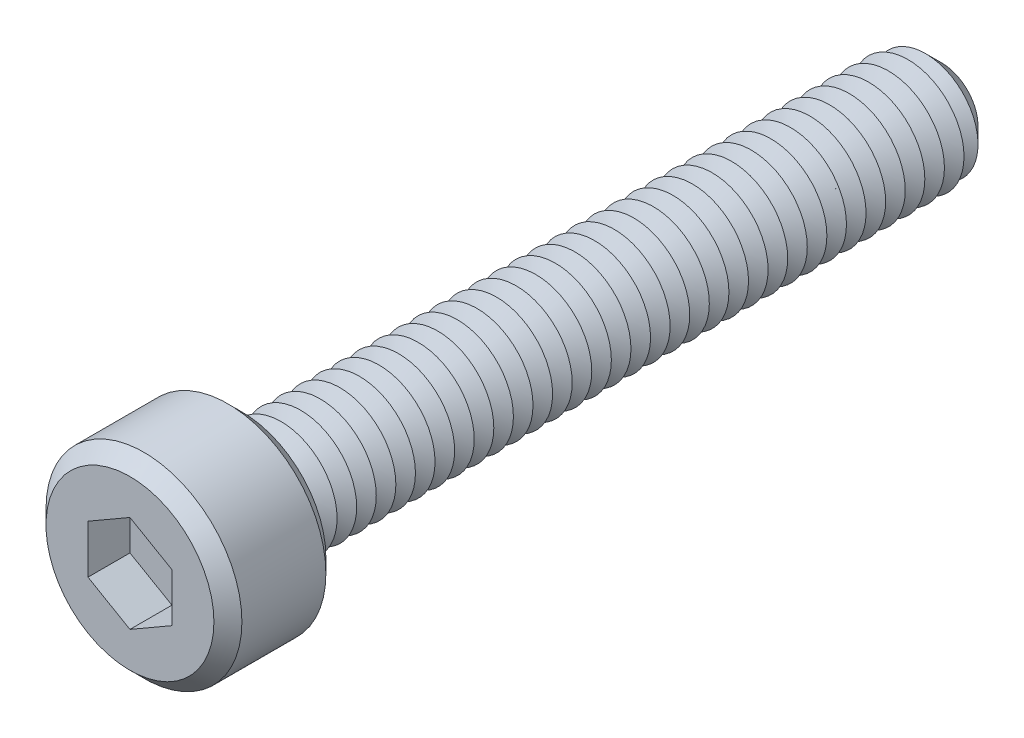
ISO-10303-21;
HEADER;
FILE_DESCRIPTION(('STEP AP214'),'2;1');
FILE_NAME('part.step','',(''),(''),'','','');
FILE_SCHEMA(('AUTOMOTIVE_DESIGN { 1 0 10303 214 1 1 1 1 }'));
ENDSEC;
DATA;
#1=APPLICATION_CONTEXT('core data for automotive mechanical design processes');
#2=APPLICATION_PROTOCOL_DEFINITION('international standard','automotive_design',2000,#1);
#3=PRODUCT_CONTEXT('',#1,'mechanical');
#4=PRODUCT('Part','Part','',(#3));
#5=PRODUCT_RELATED_PRODUCT_CATEGORY('part','',(#4));
#6=PRODUCT_DEFINITION_FORMATION('','',#4);
#7=PRODUCT_DEFINITION_CONTEXT('part definition',#1,'design');
#8=PRODUCT_DEFINITION('design','',#6,#7);
#9=PRODUCT_DEFINITION_SHAPE('','',#8);
#10=(LENGTH_UNIT() NAMED_UNIT(*) SI_UNIT(.MILLI.,.METRE.));
#11=(NAMED_UNIT(*) PLANE_ANGLE_UNIT() SI_UNIT($,.RADIAN.));
#12=(NAMED_UNIT(*) SI_UNIT($,.STERADIAN.) SOLID_ANGLE_UNIT());
#13=UNCERTAINTY_MEASURE_WITH_UNIT(LENGTH_MEASURE(1.E-05),#10,'distance_accuracy_value','');
#14=(GEOMETRIC_REPRESENTATION_CONTEXT(3) GLOBAL_UNCERTAINTY_ASSIGNED_CONTEXT((#13)) GLOBAL_UNIT_ASSIGNED_CONTEXT((#10,
#11,#12)) REPRESENTATION_CONTEXT('',''));
#15=CARTESIAN_POINT('',(0.,0.,0.));
#16=DIRECTION('',(0.,0.,1.));
#17=DIRECTION('',(1.,0.,0.));
#18=AXIS2_PLACEMENT_3D('',#15,#16,#17);
#19=CARTESIAN_POINT('',(0.,0.,4.));
#20=DIRECTION('',(0.,0.,-1.));
#21=DIRECTION('',(-1.,0.,0.));
#22=AXIS2_PLACEMENT_3D('',#19,#20,#21);
#23=CYLINDRICAL_SURFACE('',#22,3.5);
#24=CARTESIAN_POINT('',(0.,0.,0.500000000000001));
#25=DIRECTION('',(0.,0.,1.));
#26=DIRECTION('',(1.,0.,0.));
#27=AXIS2_PLACEMENT_3D('',#24,#25,#26);
#28=CIRCLE('',#27,3.5);
#29=CARTESIAN_POINT('',(3.5,0.,0.500000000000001));
#30=VERTEX_POINT('',#29);
#31=EDGE_CURVE('E456',#30,#30,#28,.T.);
#32=ORIENTED_EDGE('',*,*,#31,.T.);
#33=EDGE_LOOP('',(#32));
#34=FACE_BOUND('',#33,.T.);
#35=CARTESIAN_POINT('',(0.,0.,3.5));
#36=DIRECTION('',(0.,0.,1.));
#37=DIRECTION('',(1.,0.,0.));
#38=AXIS2_PLACEMENT_3D('',#35,#36,#37);
#39=CIRCLE('',#38,3.5);
#40=CARTESIAN_POINT('',(3.5,0.,3.5));
#41=VERTEX_POINT('',#40);
#42=EDGE_CURVE('E449',#41,#41,#39,.F.);
#43=ORIENTED_EDGE('',*,*,#42,.T.);
#44=EDGE_LOOP('',(#43));
#45=FACE_BOUND('',#44,.T.);
#46=ADVANCED_FACE('F39',(#34,#45),#23,.T.);
#47=CARTESIAN_POINT('',(0.,0.,4.));
#48=DIRECTION('',(0.,0.,1.));
#49=DIRECTION('',(1.,0.,0.));
#50=AXIS2_PLACEMENT_3D('',#47,#48,#49);
#51=PLANE('',#50);
#52=CARTESIAN_POINT('',(0.,0.,4.));
#53=DIRECTION('',(0.,0.,1.));
#54=DIRECTION('',(1.,0.,0.));
#55=AXIS2_PLACEMENT_3D('',#52,#53,#54);
#56=CIRCLE('',#55,3.);
#57=CARTESIAN_POINT('',(3.,0.,4.));
#58=VERTEX_POINT('',#57);
#59=EDGE_CURVE('E11',#58,#58,#56,.T.);
#60=ORIENTED_EDGE('',*,*,#59,.T.);
#61=EDGE_LOOP('',(#60));
#62=FACE_BOUND('',#61,.T.);
#63=DIRECTION('',(-0.866025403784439,0.5,0.));
#64=VECTOR('',#63,1.);
#65=CARTESIAN_POINT('',(1.5,0.866025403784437,4.));
#66=LINE('',#65,#64);
#67=CARTESIAN_POINT('',(1.5,0.866025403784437,4.));
#68=VERTEX_POINT('',#67);
#69=CARTESIAN_POINT('',(0.,1.73205080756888,4.));
#70=VERTEX_POINT('',#69);
#71=EDGE_CURVE('E55',#68,#70,#66,.T.);
#72=ORIENTED_EDGE('',*,*,#71,.F.);
#73=DIRECTION('',(0.,1.,0.));
#74=VECTOR('',#73,1.);
#75=CARTESIAN_POINT('',(1.5,-0.866025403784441,4.));
#76=LINE('',#75,#74);
#77=CARTESIAN_POINT('',(1.5,-0.866025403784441,4.));
#78=VERTEX_POINT('',#77);
#79=EDGE_CURVE('E150',#78,#68,#76,.T.);
#80=ORIENTED_EDGE('',*,*,#79,.F.);
#81=DIRECTION('',(0.866025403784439,0.5,0.));
#82=VECTOR('',#81,1.);
#83=CARTESIAN_POINT('',(0.,-1.73205080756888,4.));
#84=LINE('',#83,#82);
#85=CARTESIAN_POINT('',(0.,-1.73205080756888,4.));
#86=VERTEX_POINT('',#85);
#87=EDGE_CURVE('E147',#86,#78,#84,.T.);
#88=ORIENTED_EDGE('',*,*,#87,.F.);
#89=DIRECTION('',(0.866025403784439,-0.5,0.));
#90=VECTOR('',#89,1.);
#91=CARTESIAN_POINT('',(-1.5,-0.86602540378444,4.));
#92=LINE('',#91,#90);
#93=CARTESIAN_POINT('',(-1.5,-0.86602540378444,4.));
#94=VERTEX_POINT('',#93);
#95=EDGE_CURVE('E103',#94,#86,#92,.T.);
#96=ORIENTED_EDGE('',*,*,#95,.F.);
#97=DIRECTION('',(0.,-1.,0.));
#98=VECTOR('',#97,1.);
#99=CARTESIAN_POINT('',(-1.5,0.866025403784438,4.));
#100=LINE('',#99,#98);
#101=CARTESIAN_POINT('',(-1.5,0.866025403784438,4.));
#102=VERTEX_POINT('',#101);
#103=EDGE_CURVE('E141',#102,#94,#100,.T.);
#104=ORIENTED_EDGE('',*,*,#103,.F.);
#105=DIRECTION('',(-0.866025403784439,-0.5,0.));
#106=VECTOR('',#105,1.);
#107=CARTESIAN_POINT('',(0.,1.73205080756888,4.));
#108=LINE('',#107,#106);
#109=EDGE_CURVE('E136',#70,#102,#108,.T.);
#110=ORIENTED_EDGE('',*,*,#109,.F.);
#111=EDGE_LOOP('',(#72,#80,#88,#96,#104,#110));
#112=FACE_BOUND('',#111,.T.);
#113=ADVANCED_FACE('F474',(#62,#112),#51,.T.);
#114=CARTESIAN_POINT('',(0.,0.,0.));
#115=DIRECTION('',(0.,0.,1.));
#116=DIRECTION('',(1.,0.,0.));
#117=AXIS2_PLACEMENT_3D('',#114,#115,#116);
#118=PLANE('',#117);
#119=CARTESIAN_POINT('',(0.,0.,0.));
#120=DIRECTION('',(0.,0.,1.));
#121=DIRECTION('',(1.,0.,0.));
#122=AXIS2_PLACEMENT_3D('',#119,#120,#121);
#123=CIRCLE('',#122,2.99999999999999);
#124=CARTESIAN_POINT('',(2.99999999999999,0.,0.));
#125=VERTEX_POINT('',#124);
#126=EDGE_CURVE('E48',#125,#125,#123,.F.);
#127=ORIENTED_EDGE('',*,*,#126,.T.);
#128=EDGE_LOOP('',(#127));
#129=FACE_BOUND('',#128,.T.);
#130=CARTESIAN_POINT('',(0.,0.,0.));
#131=DIRECTION('',(0.,0.,1.));
#132=DIRECTION('',(1.,0.,0.));
#133=AXIS2_PLACEMENT_3D('',#130,#131,#132);
#134=CIRCLE('',#133,2.);
#135=CARTESIAN_POINT('',(2.,0.,0.));
#136=VERTEX_POINT('',#135);
#137=EDGE_CURVE('E441',#136,#136,#134,.T.);
#138=ORIENTED_EDGE('',*,*,#137,.T.);
#139=EDGE_LOOP('',(#138));
#140=FACE_BOUND('',#139,.T.);
#141=ADVANCED_FACE('F463',(#129,#140),#118,.F.);
#142=CARTESIAN_POINT('',(0.,0.,0.));
#143=DIRECTION('',(0.,0.,1.));
#144=DIRECTION('',(1.,0.,0.));
#145=AXIS2_PLACEMENT_3D('',#142,#143,#144);
#146=CONICAL_SURFACE('',#145,2.,1.0471975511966);
#147=CARTESIAN_POINT('',(0.,0.,-0.35));
#148=DIRECTION('',(0.,0.,1.));
#149=DIRECTION('',(1.,0.,0.));
#150=AXIS2_PLACEMENT_3D('',#147,#148,#149);
#151=CIRCLE('',#150,1.39378221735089);
#152=CARTESIAN_POINT('',(1.39378221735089,0.,-0.35));
#153=VERTEX_POINT('',#152);
#154=EDGE_CURVE('E437',#153,#153,#151,.T.);
#155=ORIENTED_EDGE('',*,*,#154,.T.);
#156=EDGE_LOOP('',(#155));
#157=FACE_BOUND('',#156,.T.);
#158=ORIENTED_EDGE('',*,*,#137,.F.);
#159=EDGE_LOOP('',(#158));
#160=FACE_BOUND('',#159,.T.);
#161=ADVANCED_FACE('F804',(#157,#160),#146,.T.);
#162=CARTESIAN_POINT('',(0.,0.,-0.35));
#163=DIRECTION('',(0.,0.,-1.));
#164=DIRECTION('',(-1.,0.,0.));
#165=AXIS2_PLACEMENT_3D('',#162,#163,#164);
#166=CONICAL_SURFACE('',#165,1.39378221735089,1.0471975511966);
#167=CARTESIAN_POINT('',(0.,0.,-0.7));
#168=DIRECTION('',(0.,0.,1.));
#169=DIRECTION('',(1.,0.,0.));
#170=AXIS2_PLACEMENT_3D('',#167,#168,#169);
#171=CIRCLE('',#170,2.);
#172=CARTESIAN_POINT('',(2.,0.,-0.7));
#173=VERTEX_POINT('',#172);
#174=EDGE_CURVE('E433',#173,#173,#171,.T.);
#175=ORIENTED_EDGE('',*,*,#174,.T.);
#176=EDGE_LOOP('',(#175));
#177=FACE_BOUND('',#176,.T.);
#178=ORIENTED_EDGE('',*,*,#154,.F.);
#179=EDGE_LOOP('',(#178));
#180=FACE_BOUND('',#179,.T.);
#181=ADVANCED_FACE('F800',(#177,#180),#166,.T.);
#182=CARTESIAN_POINT('',(0.,0.,-0.7));
#183=DIRECTION('',(0.,0.,1.));
#184=DIRECTION('',(1.,0.,0.));
#185=AXIS2_PLACEMENT_3D('',#182,#183,#184);
#186=CONICAL_SURFACE('',#185,2.,1.0471975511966);
#187=CARTESIAN_POINT('',(0.,0.,-1.05));
#188=DIRECTION('',(0.,0.,1.));
#189=DIRECTION('',(1.,0.,0.));
#190=AXIS2_PLACEMENT_3D('',#187,#188,#189);
#191=CIRCLE('',#190,1.39378221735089);
#192=CARTESIAN_POINT('',(1.39378221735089,0.,-1.05));
#193=VERTEX_POINT('',#192);
#194=EDGE_CURVE('E429',#193,#193,#191,.T.);
#195=ORIENTED_EDGE('',*,*,#194,.T.);
#196=EDGE_LOOP('',(#195));
#197=FACE_BOUND('',#196,.T.);
#198=ORIENTED_EDGE('',*,*,#174,.F.);
#199=EDGE_LOOP('',(#198));
#200=FACE_BOUND('',#199,.T.);
#201=ADVANCED_FACE('F796',(#197,#200),#186,.T.);
#202=CARTESIAN_POINT('',(0.,0.,-1.05));
#203=DIRECTION('',(0.,0.,-1.));
#204=DIRECTION('',(-1.,0.,0.));
#205=AXIS2_PLACEMENT_3D('',#202,#203,#204);
#206=CONICAL_SURFACE('',#205,1.39378221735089,1.0471975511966);
#207=CARTESIAN_POINT('',(0.,0.,-1.4));
#208=DIRECTION('',(0.,0.,1.));
#209=DIRECTION('',(1.,0.,0.));
#210=AXIS2_PLACEMENT_3D('',#207,#208,#209);
#211=CIRCLE('',#210,2.);
#212=CARTESIAN_POINT('',(2.,0.,-1.4));
#213=VERTEX_POINT('',#212);
#214=EDGE_CURVE('E425',#213,#213,#211,.T.);
#215=ORIENTED_EDGE('',*,*,#214,.T.);
#216=EDGE_LOOP('',(#215));
#217=FACE_BOUND('',#216,.T.);
#218=ORIENTED_EDGE('',*,*,#194,.F.);
#219=EDGE_LOOP('',(#218));
#220=FACE_BOUND('',#219,.T.);
#221=ADVANCED_FACE('F792',(#217,#220),#206,.T.);
#222=CARTESIAN_POINT('',(0.,0.,-1.4));
#223=DIRECTION('',(0.,0.,1.));
#224=DIRECTION('',(1.,0.,0.));
#225=AXIS2_PLACEMENT_3D('',#222,#223,#224);
#226=CONICAL_SURFACE('',#225,2.,1.0471975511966);
#227=CARTESIAN_POINT('',(0.,0.,-1.75));
#228=DIRECTION('',(0.,0.,1.));
#229=DIRECTION('',(1.,0.,0.));
#230=AXIS2_PLACEMENT_3D('',#227,#228,#229);
#231=CIRCLE('',#230,1.39378221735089);
#232=CARTESIAN_POINT('',(1.39378221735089,0.,-1.75));
#233=VERTEX_POINT('',#232);
#234=EDGE_CURVE('E421',#233,#233,#231,.T.);
#235=ORIENTED_EDGE('',*,*,#234,.T.);
#236=EDGE_LOOP('',(#235));
#237=FACE_BOUND('',#236,.T.);
#238=ORIENTED_EDGE('',*,*,#214,.F.);
#239=EDGE_LOOP('',(#238));
#240=FACE_BOUND('',#239,.T.);
#241=ADVANCED_FACE('F788',(#237,#240),#226,.T.);
#242=CARTESIAN_POINT('',(0.,0.,-1.75));
#243=DIRECTION('',(0.,0.,-1.));
#244=DIRECTION('',(-1.,0.,0.));
#245=AXIS2_PLACEMENT_3D('',#242,#243,#244);
#246=CONICAL_SURFACE('',#245,1.39378221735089,1.0471975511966);
#247=CARTESIAN_POINT('',(0.,0.,-2.1));
#248=DIRECTION('',(0.,0.,1.));
#249=DIRECTION('',(1.,0.,0.));
#250=AXIS2_PLACEMENT_3D('',#247,#248,#249);
#251=CIRCLE('',#250,2.);
#252=CARTESIAN_POINT('',(2.,0.,-2.1));
#253=VERTEX_POINT('',#252);
#254=EDGE_CURVE('E417',#253,#253,#251,.T.);
#255=ORIENTED_EDGE('',*,*,#254,.T.);
#256=EDGE_LOOP('',(#255));
#257=FACE_BOUND('',#256,.T.);
#258=ORIENTED_EDGE('',*,*,#234,.F.);
#259=EDGE_LOOP('',(#258));
#260=FACE_BOUND('',#259,.T.);
#261=ADVANCED_FACE('F784',(#257,#260),#246,.T.);
#262=CARTESIAN_POINT('',(0.,0.,-2.1));
#263=DIRECTION('',(0.,0.,1.));
#264=DIRECTION('',(1.,0.,0.));
#265=AXIS2_PLACEMENT_3D('',#262,#263,#264);
#266=CONICAL_SURFACE('',#265,2.,1.0471975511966);
#267=CARTESIAN_POINT('',(0.,0.,-2.45));
#268=DIRECTION('',(0.,0.,1.));
#269=DIRECTION('',(1.,0.,0.));
#270=AXIS2_PLACEMENT_3D('',#267,#268,#269);
#271=CIRCLE('',#270,1.39378221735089);
#272=CARTESIAN_POINT('',(1.39378221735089,0.,-2.45));
#273=VERTEX_POINT('',#272);
#274=EDGE_CURVE('E413',#273,#273,#271,.T.);
#275=ORIENTED_EDGE('',*,*,#274,.T.);
#276=EDGE_LOOP('',(#275));
#277=FACE_BOUND('',#276,.T.);
#278=ORIENTED_EDGE('',*,*,#254,.F.);
#279=EDGE_LOOP('',(#278));
#280=FACE_BOUND('',#279,.T.);
#281=ADVANCED_FACE('F780',(#277,#280),#266,.T.);
#282=CARTESIAN_POINT('',(0.,0.,-2.45));
#283=DIRECTION('',(0.,0.,-1.));
#284=DIRECTION('',(-1.,0.,0.));
#285=AXIS2_PLACEMENT_3D('',#282,#283,#284);
#286=CONICAL_SURFACE('',#285,1.39378221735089,1.0471975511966);
#287=CARTESIAN_POINT('',(0.,0.,-2.8));
#288=DIRECTION('',(0.,0.,1.));
#289=DIRECTION('',(1.,0.,0.));
#290=AXIS2_PLACEMENT_3D('',#287,#288,#289);
#291=CIRCLE('',#290,2.);
#292=CARTESIAN_POINT('',(2.,0.,-2.8));
#293=VERTEX_POINT('',#292);
#294=EDGE_CURVE('E409',#293,#293,#291,.T.);
#295=ORIENTED_EDGE('',*,*,#294,.T.);
#296=EDGE_LOOP('',(#295));
#297=FACE_BOUND('',#296,.T.);
#298=ORIENTED_EDGE('',*,*,#274,.F.);
#299=EDGE_LOOP('',(#298));
#300=FACE_BOUND('',#299,.T.);
#301=ADVANCED_FACE('F776',(#297,#300),#286,.T.);
#302=CARTESIAN_POINT('',(0.,0.,-2.8));
#303=DIRECTION('',(0.,0.,1.));
#304=DIRECTION('',(1.,0.,0.));
#305=AXIS2_PLACEMENT_3D('',#302,#303,#304);
#306=CONICAL_SURFACE('',#305,2.,1.0471975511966);
#307=CARTESIAN_POINT('',(0.,0.,-3.15));
#308=DIRECTION('',(0.,0.,1.));
#309=DIRECTION('',(1.,0.,0.));
#310=AXIS2_PLACEMENT_3D('',#307,#308,#309);
#311=CIRCLE('',#310,1.39378221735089);
#312=CARTESIAN_POINT('',(1.39378221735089,0.,-3.15));
#313=VERTEX_POINT('',#312);
#314=EDGE_CURVE('E405',#313,#313,#311,.T.);
#315=ORIENTED_EDGE('',*,*,#314,.T.);
#316=EDGE_LOOP('',(#315));
#317=FACE_BOUND('',#316,.T.);
#318=ORIENTED_EDGE('',*,*,#294,.F.);
#319=EDGE_LOOP('',(#318));
#320=FACE_BOUND('',#319,.T.);
#321=ADVANCED_FACE('F772',(#317,#320),#306,.T.);
#322=CARTESIAN_POINT('',(0.,0.,-3.15));
#323=DIRECTION('',(0.,0.,-1.));
#324=DIRECTION('',(-1.,0.,0.));
#325=AXIS2_PLACEMENT_3D('',#322,#323,#324);
#326=CONICAL_SURFACE('',#325,1.39378221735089,1.0471975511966);
#327=CARTESIAN_POINT('',(0.,0.,-3.5));
#328=DIRECTION('',(0.,0.,1.));
#329=DIRECTION('',(1.,0.,0.));
#330=AXIS2_PLACEMENT_3D('',#327,#328,#329);
#331=CIRCLE('',#330,2.);
#332=CARTESIAN_POINT('',(2.,0.,-3.5));
#333=VERTEX_POINT('',#332);
#334=EDGE_CURVE('E401',#333,#333,#331,.T.);
#335=ORIENTED_EDGE('',*,*,#334,.T.);
#336=EDGE_LOOP('',(#335));
#337=FACE_BOUND('',#336,.T.);
#338=ORIENTED_EDGE('',*,*,#314,.F.);
#339=EDGE_LOOP('',(#338));
#340=FACE_BOUND('',#339,.T.);
#341=ADVANCED_FACE('F768',(#337,#340),#326,.T.);
#342=CARTESIAN_POINT('',(0.,0.,-3.5));
#343=DIRECTION('',(0.,0.,1.));
#344=DIRECTION('',(1.,0.,0.));
#345=AXIS2_PLACEMENT_3D('',#342,#343,#344);
#346=CONICAL_SURFACE('',#345,2.,1.0471975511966);
#347=CARTESIAN_POINT('',(0.,0.,-3.85));
#348=DIRECTION('',(0.,0.,1.));
#349=DIRECTION('',(1.,0.,0.));
#350=AXIS2_PLACEMENT_3D('',#347,#348,#349);
#351=CIRCLE('',#350,1.39378221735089);
#352=CARTESIAN_POINT('',(1.39378221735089,0.,-3.85));
#353=VERTEX_POINT('',#352);
#354=EDGE_CURVE('E397',#353,#353,#351,.T.);
#355=ORIENTED_EDGE('',*,*,#354,.T.);
#356=EDGE_LOOP('',(#355));
#357=FACE_BOUND('',#356,.T.);
#358=ORIENTED_EDGE('',*,*,#334,.F.);
#359=EDGE_LOOP('',(#358));
#360=FACE_BOUND('',#359,.T.);
#361=ADVANCED_FACE('F764',(#357,#360),#346,.T.);
#362=CARTESIAN_POINT('',(0.,0.,-3.85));
#363=DIRECTION('',(0.,0.,-1.));
#364=DIRECTION('',(-1.,0.,0.));
#365=AXIS2_PLACEMENT_3D('',#362,#363,#364);
#366=CONICAL_SURFACE('',#365,1.39378221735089,1.0471975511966);
#367=CARTESIAN_POINT('',(0.,0.,-4.2));
#368=DIRECTION('',(0.,0.,1.));
#369=DIRECTION('',(1.,0.,0.));
#370=AXIS2_PLACEMENT_3D('',#367,#368,#369);
#371=CIRCLE('',#370,2.);
#372=CARTESIAN_POINT('',(2.,0.,-4.2));
#373=VERTEX_POINT('',#372);
#374=EDGE_CURVE('E393',#373,#373,#371,.T.);
#375=ORIENTED_EDGE('',*,*,#374,.T.);
#376=EDGE_LOOP('',(#375));
#377=FACE_BOUND('',#376,.T.);
#378=ORIENTED_EDGE('',*,*,#354,.F.);
#379=EDGE_LOOP('',(#378));
#380=FACE_BOUND('',#379,.T.);
#381=ADVANCED_FACE('F760',(#377,#380),#366,.T.);
#382=CARTESIAN_POINT('',(0.,0.,-4.2));
#383=DIRECTION('',(0.,0.,1.));
#384=DIRECTION('',(1.,0.,0.));
#385=AXIS2_PLACEMENT_3D('',#382,#383,#384);
#386=CONICAL_SURFACE('',#385,2.,1.0471975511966);
#387=CARTESIAN_POINT('',(0.,0.,-4.55));
#388=DIRECTION('',(0.,0.,1.));
#389=DIRECTION('',(1.,0.,0.));
#390=AXIS2_PLACEMENT_3D('',#387,#388,#389);
#391=CIRCLE('',#390,1.39378221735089);
#392=CARTESIAN_POINT('',(1.39378221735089,0.,-4.55));
#393=VERTEX_POINT('',#392);
#394=EDGE_CURVE('E389',#393,#393,#391,.T.);
#395=ORIENTED_EDGE('',*,*,#394,.T.);
#396=EDGE_LOOP('',(#395));
#397=FACE_BOUND('',#396,.T.);
#398=ORIENTED_EDGE('',*,*,#374,.F.);
#399=EDGE_LOOP('',(#398));
#400=FACE_BOUND('',#399,.T.);
#401=ADVANCED_FACE('F756',(#397,#400),#386,.T.);
#402=CARTESIAN_POINT('',(0.,0.,-4.55));
#403=DIRECTION('',(0.,0.,-1.));
#404=DIRECTION('',(-1.,0.,0.));
#405=AXIS2_PLACEMENT_3D('',#402,#403,#404);
#406=CONICAL_SURFACE('',#405,1.39378221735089,1.0471975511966);
#407=CARTESIAN_POINT('',(0.,0.,-4.9));
#408=DIRECTION('',(0.,0.,1.));
#409=DIRECTION('',(1.,0.,0.));
#410=AXIS2_PLACEMENT_3D('',#407,#408,#409);
#411=CIRCLE('',#410,2.);
#412=CARTESIAN_POINT('',(2.,0.,-4.9));
#413=VERTEX_POINT('',#412);
#414=EDGE_CURVE('E385',#413,#413,#411,.T.);
#415=ORIENTED_EDGE('',*,*,#414,.T.);
#416=EDGE_LOOP('',(#415));
#417=FACE_BOUND('',#416,.T.);
#418=ORIENTED_EDGE('',*,*,#394,.F.);
#419=EDGE_LOOP('',(#418));
#420=FACE_BOUND('',#419,.T.);
#421=ADVANCED_FACE('F752',(#417,#420),#406,.T.);
#422=CARTESIAN_POINT('',(0.,0.,-4.9));
#423=DIRECTION('',(0.,0.,1.));
#424=DIRECTION('',(1.,0.,0.));
#425=AXIS2_PLACEMENT_3D('',#422,#423,#424);
#426=CONICAL_SURFACE('',#425,2.,1.0471975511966);
#427=CARTESIAN_POINT('',(0.,0.,-5.25));
#428=DIRECTION('',(0.,0.,1.));
#429=DIRECTION('',(1.,0.,0.));
#430=AXIS2_PLACEMENT_3D('',#427,#428,#429);
#431=CIRCLE('',#430,1.39378221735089);
#432=CARTESIAN_POINT('',(1.39378221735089,0.,-5.25));
#433=VERTEX_POINT('',#432);
#434=EDGE_CURVE('E381',#433,#433,#431,.T.);
#435=ORIENTED_EDGE('',*,*,#434,.T.);
#436=EDGE_LOOP('',(#435));
#437=FACE_BOUND('',#436,.T.);
#438=ORIENTED_EDGE('',*,*,#414,.F.);
#439=EDGE_LOOP('',(#438));
#440=FACE_BOUND('',#439,.T.);
#441=ADVANCED_FACE('F748',(#437,#440),#426,.T.);
#442=CARTESIAN_POINT('',(0.,0.,-5.25));
#443=DIRECTION('',(0.,0.,-1.));
#444=DIRECTION('',(-1.,0.,0.));
#445=AXIS2_PLACEMENT_3D('',#442,#443,#444);
#446=CONICAL_SURFACE('',#445,1.39378221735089,1.0471975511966);
#447=CARTESIAN_POINT('',(0.,0.,-5.6));
#448=DIRECTION('',(0.,0.,1.));
#449=DIRECTION('',(1.,0.,0.));
#450=AXIS2_PLACEMENT_3D('',#447,#448,#449);
#451=CIRCLE('',#450,2.);
#452=CARTESIAN_POINT('',(2.,0.,-5.6));
#453=VERTEX_POINT('',#452);
#454=EDGE_CURVE('E377',#453,#453,#451,.T.);
#455=ORIENTED_EDGE('',*,*,#454,.T.);
#456=EDGE_LOOP('',(#455));
#457=FACE_BOUND('',#456,.T.);
#458=ORIENTED_EDGE('',*,*,#434,.F.);
#459=EDGE_LOOP('',(#458));
#460=FACE_BOUND('',#459,.T.);
#461=ADVANCED_FACE('F744',(#457,#460),#446,.T.);
#462=CARTESIAN_POINT('',(0.,0.,-5.6));
#463=DIRECTION('',(0.,0.,1.));
#464=DIRECTION('',(1.,0.,0.));
#465=AXIS2_PLACEMENT_3D('',#462,#463,#464);
#466=CONICAL_SURFACE('',#465,2.,1.0471975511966);
#467=CARTESIAN_POINT('',(0.,0.,-5.95));
#468=DIRECTION('',(0.,0.,1.));
#469=DIRECTION('',(1.,0.,0.));
#470=AXIS2_PLACEMENT_3D('',#467,#468,#469);
#471=CIRCLE('',#470,1.39378221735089);
#472=CARTESIAN_POINT('',(1.39378221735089,0.,-5.95));
#473=VERTEX_POINT('',#472);
#474=EDGE_CURVE('E373',#473,#473,#471,.T.);
#475=ORIENTED_EDGE('',*,*,#474,.T.);
#476=EDGE_LOOP('',(#475));
#477=FACE_BOUND('',#476,.T.);
#478=ORIENTED_EDGE('',*,*,#454,.F.);
#479=EDGE_LOOP('',(#478));
#480=FACE_BOUND('',#479,.T.);
#481=ADVANCED_FACE('F740',(#477,#480),#466,.T.);
#482=CARTESIAN_POINT('',(0.,0.,-5.95));
#483=DIRECTION('',(0.,0.,-1.));
#484=DIRECTION('',(-1.,0.,0.));
#485=AXIS2_PLACEMENT_3D('',#482,#483,#484);
#486=CONICAL_SURFACE('',#485,1.39378221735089,1.0471975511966);
#487=CARTESIAN_POINT('',(0.,0.,-6.3));
#488=DIRECTION('',(0.,0.,1.));
#489=DIRECTION('',(1.,0.,0.));
#490=AXIS2_PLACEMENT_3D('',#487,#488,#489);
#491=CIRCLE('',#490,2.);
#492=CARTESIAN_POINT('',(2.,0.,-6.3));
#493=VERTEX_POINT('',#492);
#494=EDGE_CURVE('E369',#493,#493,#491,.T.);
#495=ORIENTED_EDGE('',*,*,#494,.T.);
#496=EDGE_LOOP('',(#495));
#497=FACE_BOUND('',#496,.T.);
#498=ORIENTED_EDGE('',*,*,#474,.F.);
#499=EDGE_LOOP('',(#498));
#500=FACE_BOUND('',#499,.T.);
#501=ADVANCED_FACE('F736',(#497,#500),#486,.T.);
#502=CARTESIAN_POINT('',(0.,0.,-6.3));
#503=DIRECTION('',(0.,0.,1.));
#504=DIRECTION('',(1.,0.,0.));
#505=AXIS2_PLACEMENT_3D('',#502,#503,#504);
#506=CONICAL_SURFACE('',#505,2.,1.0471975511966);
#507=CARTESIAN_POINT('',(0.,0.,-6.65));
#508=DIRECTION('',(0.,0.,1.));
#509=DIRECTION('',(1.,0.,0.));
#510=AXIS2_PLACEMENT_3D('',#507,#508,#509);
#511=CIRCLE('',#510,1.39378221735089);
#512=CARTESIAN_POINT('',(1.39378221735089,0.,-6.65));
#513=VERTEX_POINT('',#512);
#514=EDGE_CURVE('E365',#513,#513,#511,.T.);
#515=ORIENTED_EDGE('',*,*,#514,.T.);
#516=EDGE_LOOP('',(#515));
#517=FACE_BOUND('',#516,.T.);
#518=ORIENTED_EDGE('',*,*,#494,.F.);
#519=EDGE_LOOP('',(#518));
#520=FACE_BOUND('',#519,.T.);
#521=ADVANCED_FACE('F732',(#517,#520),#506,.T.);
#522=CARTESIAN_POINT('',(0.,0.,-6.65));
#523=DIRECTION('',(0.,0.,-1.));
#524=DIRECTION('',(-1.,0.,0.));
#525=AXIS2_PLACEMENT_3D('',#522,#523,#524);
#526=CONICAL_SURFACE('',#525,1.39378221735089,1.0471975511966);
#527=CARTESIAN_POINT('',(0.,0.,-7.));
#528=DIRECTION('',(0.,0.,1.));
#529=DIRECTION('',(1.,0.,0.));
#530=AXIS2_PLACEMENT_3D('',#527,#528,#529);
#531=CIRCLE('',#530,2.);
#532=CARTESIAN_POINT('',(2.,0.,-7.));
#533=VERTEX_POINT('',#532);
#534=EDGE_CURVE('E361',#533,#533,#531,.T.);
#535=ORIENTED_EDGE('',*,*,#534,.T.);
#536=EDGE_LOOP('',(#535));
#537=FACE_BOUND('',#536,.T.);
#538=ORIENTED_EDGE('',*,*,#514,.F.);
#539=EDGE_LOOP('',(#538));
#540=FACE_BOUND('',#539,.T.);
#541=ADVANCED_FACE('F728',(#537,#540),#526,.T.);
#542=CARTESIAN_POINT('',(0.,0.,-7.));
#543=DIRECTION('',(0.,0.,1.));
#544=DIRECTION('',(1.,0.,0.));
#545=AXIS2_PLACEMENT_3D('',#542,#543,#544);
#546=CONICAL_SURFACE('',#545,2.,1.0471975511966);
#547=CARTESIAN_POINT('',(0.,0.,-7.35));
#548=DIRECTION('',(0.,0.,1.));
#549=DIRECTION('',(1.,0.,0.));
#550=AXIS2_PLACEMENT_3D('',#547,#548,#549);
#551=CIRCLE('',#550,1.39378221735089);
#552=CARTESIAN_POINT('',(1.39378221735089,0.,-7.35));
#553=VERTEX_POINT('',#552);
#554=EDGE_CURVE('E357',#553,#553,#551,.T.);
#555=ORIENTED_EDGE('',*,*,#554,.T.);
#556=EDGE_LOOP('',(#555));
#557=FACE_BOUND('',#556,.T.);
#558=ORIENTED_EDGE('',*,*,#534,.F.);
#559=EDGE_LOOP('',(#558));
#560=FACE_BOUND('',#559,.T.);
#561=ADVANCED_FACE('F724',(#557,#560),#546,.T.);
#562=CARTESIAN_POINT('',(0.,0.,-7.35));
#563=DIRECTION('',(0.,0.,-1.));
#564=DIRECTION('',(-1.,0.,0.));
#565=AXIS2_PLACEMENT_3D('',#562,#563,#564);
#566=CONICAL_SURFACE('',#565,1.39378221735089,1.0471975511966);
#567=CARTESIAN_POINT('',(0.,0.,-7.7));
#568=DIRECTION('',(0.,0.,1.));
#569=DIRECTION('',(1.,0.,0.));
#570=AXIS2_PLACEMENT_3D('',#567,#568,#569);
#571=CIRCLE('',#570,2.);
#572=CARTESIAN_POINT('',(2.,0.,-7.7));
#573=VERTEX_POINT('',#572);
#574=EDGE_CURVE('E353',#573,#573,#571,.T.);
#575=ORIENTED_EDGE('',*,*,#574,.T.);
#576=EDGE_LOOP('',(#575));
#577=FACE_BOUND('',#576,.T.);
#578=ORIENTED_EDGE('',*,*,#554,.F.);
#579=EDGE_LOOP('',(#578));
#580=FACE_BOUND('',#579,.T.);
#581=ADVANCED_FACE('F720',(#577,#580),#566,.T.);
#582=CARTESIAN_POINT('',(0.,0.,-7.7));
#583=DIRECTION('',(0.,0.,1.));
#584=DIRECTION('',(1.,0.,0.));
#585=AXIS2_PLACEMENT_3D('',#582,#583,#584);
#586=CONICAL_SURFACE('',#585,2.,1.0471975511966);
#587=CARTESIAN_POINT('',(0.,0.,-8.05));
#588=DIRECTION('',(0.,0.,1.));
#589=DIRECTION('',(1.,0.,0.));
#590=AXIS2_PLACEMENT_3D('',#587,#588,#589);
#591=CIRCLE('',#590,1.39378221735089);
#592=CARTESIAN_POINT('',(1.39378221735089,0.,-8.05));
#593=VERTEX_POINT('',#592);
#594=EDGE_CURVE('E349',#593,#593,#591,.T.);
#595=ORIENTED_EDGE('',*,*,#594,.T.);
#596=EDGE_LOOP('',(#595));
#597=FACE_BOUND('',#596,.T.);
#598=ORIENTED_EDGE('',*,*,#574,.F.);
#599=EDGE_LOOP('',(#598));
#600=FACE_BOUND('',#599,.T.);
#601=ADVANCED_FACE('F716',(#597,#600),#586,.T.);
#602=CARTESIAN_POINT('',(0.,0.,-8.05));
#603=DIRECTION('',(0.,0.,-1.));
#604=DIRECTION('',(-1.,0.,0.));
#605=AXIS2_PLACEMENT_3D('',#602,#603,#604);
#606=CONICAL_SURFACE('',#605,1.39378221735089,1.0471975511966);
#607=CARTESIAN_POINT('',(0.,0.,-8.4));
#608=DIRECTION('',(0.,0.,1.));
#609=DIRECTION('',(1.,0.,0.));
#610=AXIS2_PLACEMENT_3D('',#607,#608,#609);
#611=CIRCLE('',#610,2.);
#612=CARTESIAN_POINT('',(2.,0.,-8.4));
#613=VERTEX_POINT('',#612);
#614=EDGE_CURVE('E345',#613,#613,#611,.T.);
#615=ORIENTED_EDGE('',*,*,#614,.T.);
#616=EDGE_LOOP('',(#615));
#617=FACE_BOUND('',#616,.T.);
#618=ORIENTED_EDGE('',*,*,#594,.F.);
#619=EDGE_LOOP('',(#618));
#620=FACE_BOUND('',#619,.T.);
#621=ADVANCED_FACE('F712',(#617,#620),#606,.T.);
#622=CARTESIAN_POINT('',(0.,0.,-8.4));
#623=DIRECTION('',(0.,0.,1.));
#624=DIRECTION('',(1.,0.,0.));
#625=AXIS2_PLACEMENT_3D('',#622,#623,#624);
#626=CONICAL_SURFACE('',#625,2.,1.0471975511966);
#627=CARTESIAN_POINT('',(0.,0.,-8.75));
#628=DIRECTION('',(0.,0.,1.));
#629=DIRECTION('',(1.,0.,0.));
#630=AXIS2_PLACEMENT_3D('',#627,#628,#629);
#631=CIRCLE('',#630,1.39378221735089);
#632=CARTESIAN_POINT('',(1.39378221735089,0.,-8.75));
#633=VERTEX_POINT('',#632);
#634=EDGE_CURVE('E341',#633,#633,#631,.T.);
#635=ORIENTED_EDGE('',*,*,#634,.T.);
#636=EDGE_LOOP('',(#635));
#637=FACE_BOUND('',#636,.T.);
#638=ORIENTED_EDGE('',*,*,#614,.F.);
#639=EDGE_LOOP('',(#638));
#640=FACE_BOUND('',#639,.T.);
#641=ADVANCED_FACE('F708',(#637,#640),#626,.T.);
#642=CARTESIAN_POINT('',(0.,0.,-8.75));
#643=DIRECTION('',(0.,0.,-1.));
#644=DIRECTION('',(-1.,0.,0.));
#645=AXIS2_PLACEMENT_3D('',#642,#643,#644);
#646=CONICAL_SURFACE('',#645,1.39378221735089,1.0471975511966);
#647=CARTESIAN_POINT('',(0.,0.,-9.1));
#648=DIRECTION('',(0.,0.,1.));
#649=DIRECTION('',(1.,0.,0.));
#650=AXIS2_PLACEMENT_3D('',#647,#648,#649);
#651=CIRCLE('',#650,2.);
#652=CARTESIAN_POINT('',(2.,0.,-9.1));
#653=VERTEX_POINT('',#652);
#654=EDGE_CURVE('E337',#653,#653,#651,.T.);
#655=ORIENTED_EDGE('',*,*,#654,.T.);
#656=EDGE_LOOP('',(#655));
#657=FACE_BOUND('',#656,.T.);
#658=ORIENTED_EDGE('',*,*,#634,.F.);
#659=EDGE_LOOP('',(#658));
#660=FACE_BOUND('',#659,.T.);
#661=ADVANCED_FACE('F704',(#657,#660),#646,.T.);
#662=CARTESIAN_POINT('',(0.,0.,-9.1));
#663=DIRECTION('',(0.,0.,1.));
#664=DIRECTION('',(1.,0.,0.));
#665=AXIS2_PLACEMENT_3D('',#662,#663,#664);
#666=CONICAL_SURFACE('',#665,2.,1.0471975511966);
#667=CARTESIAN_POINT('',(0.,0.,-9.45));
#668=DIRECTION('',(0.,0.,1.));
#669=DIRECTION('',(1.,0.,0.));
#670=AXIS2_PLACEMENT_3D('',#667,#668,#669);
#671=CIRCLE('',#670,1.39378221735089);
#672=CARTESIAN_POINT('',(1.39378221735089,0.,-9.45));
#673=VERTEX_POINT('',#672);
#674=EDGE_CURVE('E333',#673,#673,#671,.T.);
#675=ORIENTED_EDGE('',*,*,#674,.T.);
#676=EDGE_LOOP('',(#675));
#677=FACE_BOUND('',#676,.T.);
#678=ORIENTED_EDGE('',*,*,#654,.F.);
#679=EDGE_LOOP('',(#678));
#680=FACE_BOUND('',#679,.T.);
#681=ADVANCED_FACE('F700',(#677,#680),#666,.T.);
#682=CARTESIAN_POINT('',(0.,0.,-9.45));
#683=DIRECTION('',(0.,0.,-1.));
#684=DIRECTION('',(-1.,0.,0.));
#685=AXIS2_PLACEMENT_3D('',#682,#683,#684);
#686=CONICAL_SURFACE('',#685,1.39378221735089,1.0471975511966);
#687=CARTESIAN_POINT('',(0.,0.,-9.8));
#688=DIRECTION('',(0.,0.,1.));
#689=DIRECTION('',(1.,0.,0.));
#690=AXIS2_PLACEMENT_3D('',#687,#688,#689);
#691=CIRCLE('',#690,2.);
#692=CARTESIAN_POINT('',(2.,0.,-9.8));
#693=VERTEX_POINT('',#692);
#694=EDGE_CURVE('E329',#693,#693,#691,.T.);
#695=ORIENTED_EDGE('',*,*,#694,.T.);
#696=EDGE_LOOP('',(#695));
#697=FACE_BOUND('',#696,.T.);
#698=ORIENTED_EDGE('',*,*,#674,.F.);
#699=EDGE_LOOP('',(#698));
#700=FACE_BOUND('',#699,.T.);
#701=ADVANCED_FACE('F696',(#697,#700),#686,.T.);
#702=CARTESIAN_POINT('',(0.,0.,-9.8));
#703=DIRECTION('',(0.,0.,1.));
#704=DIRECTION('',(1.,0.,0.));
#705=AXIS2_PLACEMENT_3D('',#702,#703,#704);
#706=CONICAL_SURFACE('',#705,2.,1.0471975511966);
#707=CARTESIAN_POINT('',(0.,0.,-10.15));
#708=DIRECTION('',(0.,0.,1.));
#709=DIRECTION('',(1.,0.,0.));
#710=AXIS2_PLACEMENT_3D('',#707,#708,#709);
#711=CIRCLE('',#710,1.39378221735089);
#712=CARTESIAN_POINT('',(1.39378221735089,0.,-10.15));
#713=VERTEX_POINT('',#712);
#714=EDGE_CURVE('E325',#713,#713,#711,.T.);
#715=ORIENTED_EDGE('',*,*,#714,.T.);
#716=EDGE_LOOP('',(#715));
#717=FACE_BOUND('',#716,.T.);
#718=ORIENTED_EDGE('',*,*,#694,.F.);
#719=EDGE_LOOP('',(#718));
#720=FACE_BOUND('',#719,.T.);
#721=ADVANCED_FACE('F692',(#717,#720),#706,.T.);
#722=CARTESIAN_POINT('',(0.,0.,-10.15));
#723=DIRECTION('',(0.,0.,-1.));
#724=DIRECTION('',(-1.,0.,0.));
#725=AXIS2_PLACEMENT_3D('',#722,#723,#724);
#726=CONICAL_SURFACE('',#725,1.39378221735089,1.0471975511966);
#727=CARTESIAN_POINT('',(0.,0.,-10.5));
#728=DIRECTION('',(0.,0.,1.));
#729=DIRECTION('',(1.,0.,0.));
#730=AXIS2_PLACEMENT_3D('',#727,#728,#729);
#731=CIRCLE('',#730,2.);
#732=CARTESIAN_POINT('',(2.,0.,-10.5));
#733=VERTEX_POINT('',#732);
#734=EDGE_CURVE('E321',#733,#733,#731,.T.);
#735=ORIENTED_EDGE('',*,*,#734,.T.);
#736=EDGE_LOOP('',(#735));
#737=FACE_BOUND('',#736,.T.);
#738=ORIENTED_EDGE('',*,*,#714,.F.);
#739=EDGE_LOOP('',(#738));
#740=FACE_BOUND('',#739,.T.);
#741=ADVANCED_FACE('F688',(#737,#740),#726,.T.);
#742=CARTESIAN_POINT('',(0.,0.,-10.5));
#743=DIRECTION('',(0.,0.,1.));
#744=DIRECTION('',(1.,0.,0.));
#745=AXIS2_PLACEMENT_3D('',#742,#743,#744);
#746=CONICAL_SURFACE('',#745,2.,1.0471975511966);
#747=CARTESIAN_POINT('',(0.,0.,-10.85));
#748=DIRECTION('',(0.,0.,1.));
#749=DIRECTION('',(1.,0.,0.));
#750=AXIS2_PLACEMENT_3D('',#747,#748,#749);
#751=CIRCLE('',#750,1.39378221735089);
#752=CARTESIAN_POINT('',(1.39378221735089,0.,-10.85));
#753=VERTEX_POINT('',#752);
#754=EDGE_CURVE('E317',#753,#753,#751,.T.);
#755=ORIENTED_EDGE('',*,*,#754,.T.);
#756=EDGE_LOOP('',(#755));
#757=FACE_BOUND('',#756,.T.);
#758=ORIENTED_EDGE('',*,*,#734,.F.);
#759=EDGE_LOOP('',(#758));
#760=FACE_BOUND('',#759,.T.);
#761=ADVANCED_FACE('F684',(#757,#760),#746,.T.);
#762=CARTESIAN_POINT('',(0.,0.,-10.85));
#763=DIRECTION('',(0.,0.,-1.));
#764=DIRECTION('',(-1.,0.,0.));
#765=AXIS2_PLACEMENT_3D('',#762,#763,#764);
#766=CONICAL_SURFACE('',#765,1.39378221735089,1.0471975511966);
#767=CARTESIAN_POINT('',(0.,0.,-11.2));
#768=DIRECTION('',(0.,0.,1.));
#769=DIRECTION('',(1.,0.,0.));
#770=AXIS2_PLACEMENT_3D('',#767,#768,#769);
#771=CIRCLE('',#770,2.);
#772=CARTESIAN_POINT('',(2.,0.,-11.2));
#773=VERTEX_POINT('',#772);
#774=EDGE_CURVE('E313',#773,#773,#771,.T.);
#775=ORIENTED_EDGE('',*,*,#774,.T.);
#776=EDGE_LOOP('',(#775));
#777=FACE_BOUND('',#776,.T.);
#778=ORIENTED_EDGE('',*,*,#754,.F.);
#779=EDGE_LOOP('',(#778));
#780=FACE_BOUND('',#779,.T.);
#781=ADVANCED_FACE('F680',(#777,#780),#766,.T.);
#782=CARTESIAN_POINT('',(0.,0.,-11.2));
#783=DIRECTION('',(0.,0.,1.));
#784=DIRECTION('',(1.,0.,0.));
#785=AXIS2_PLACEMENT_3D('',#782,#783,#784);
#786=CONICAL_SURFACE('',#785,2.,1.0471975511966);
#787=CARTESIAN_POINT('',(0.,0.,-11.55));
#788=DIRECTION('',(0.,0.,1.));
#789=DIRECTION('',(1.,0.,0.));
#790=AXIS2_PLACEMENT_3D('',#787,#788,#789);
#791=CIRCLE('',#790,1.39378221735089);
#792=CARTESIAN_POINT('',(1.39378221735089,0.,-11.55));
#793=VERTEX_POINT('',#792);
#794=EDGE_CURVE('E309',#793,#793,#791,.T.);
#795=ORIENTED_EDGE('',*,*,#794,.T.);
#796=EDGE_LOOP('',(#795));
#797=FACE_BOUND('',#796,.T.);
#798=ORIENTED_EDGE('',*,*,#774,.F.);
#799=EDGE_LOOP('',(#798));
#800=FACE_BOUND('',#799,.T.);
#801=ADVANCED_FACE('F676',(#797,#800),#786,.T.);
#802=CARTESIAN_POINT('',(0.,0.,-11.55));
#803=DIRECTION('',(0.,0.,-1.));
#804=DIRECTION('',(-1.,0.,0.));
#805=AXIS2_PLACEMENT_3D('',#802,#803,#804);
#806=CONICAL_SURFACE('',#805,1.39378221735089,1.0471975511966);
#807=CARTESIAN_POINT('',(0.,0.,-11.9));
#808=DIRECTION('',(0.,0.,1.));
#809=DIRECTION('',(1.,0.,0.));
#810=AXIS2_PLACEMENT_3D('',#807,#808,#809);
#811=CIRCLE('',#810,2.);
#812=CARTESIAN_POINT('',(2.,0.,-11.9));
#813=VERTEX_POINT('',#812);
#814=EDGE_CURVE('E305',#813,#813,#811,.T.);
#815=ORIENTED_EDGE('',*,*,#814,.T.);
#816=EDGE_LOOP('',(#815));
#817=FACE_BOUND('',#816,.T.);
#818=ORIENTED_EDGE('',*,*,#794,.F.);
#819=EDGE_LOOP('',(#818));
#820=FACE_BOUND('',#819,.T.);
#821=ADVANCED_FACE('F672',(#817,#820),#806,.T.);
#822=CARTESIAN_POINT('',(0.,0.,-11.9));
#823=DIRECTION('',(0.,0.,1.));
#824=DIRECTION('',(1.,0.,0.));
#825=AXIS2_PLACEMENT_3D('',#822,#823,#824);
#826=CONICAL_SURFACE('',#825,2.,1.0471975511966);
#827=CARTESIAN_POINT('',(0.,0.,-12.25));
#828=DIRECTION('',(0.,0.,1.));
#829=DIRECTION('',(1.,0.,0.));
#830=AXIS2_PLACEMENT_3D('',#827,#828,#829);
#831=CIRCLE('',#830,1.39378221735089);
#832=CARTESIAN_POINT('',(1.39378221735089,0.,-12.25));
#833=VERTEX_POINT('',#832);
#834=EDGE_CURVE('E301',#833,#833,#831,.T.);
#835=ORIENTED_EDGE('',*,*,#834,.T.);
#836=EDGE_LOOP('',(#835));
#837=FACE_BOUND('',#836,.T.);
#838=ORIENTED_EDGE('',*,*,#814,.F.);
#839=EDGE_LOOP('',(#838));
#840=FACE_BOUND('',#839,.T.);
#841=ADVANCED_FACE('F668',(#837,#840),#826,.T.);
#842=CARTESIAN_POINT('',(0.,0.,-12.25));
#843=DIRECTION('',(0.,0.,-1.));
#844=DIRECTION('',(-1.,0.,0.));
#845=AXIS2_PLACEMENT_3D('',#842,#843,#844);
#846=CONICAL_SURFACE('',#845,1.39378221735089,1.0471975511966);
#847=CARTESIAN_POINT('',(0.,0.,-12.6));
#848=DIRECTION('',(0.,0.,1.));
#849=DIRECTION('',(1.,0.,0.));
#850=AXIS2_PLACEMENT_3D('',#847,#848,#849);
#851=CIRCLE('',#850,2.);
#852=CARTESIAN_POINT('',(2.,0.,-12.6));
#853=VERTEX_POINT('',#852);
#854=EDGE_CURVE('E297',#853,#853,#851,.T.);
#855=ORIENTED_EDGE('',*,*,#854,.T.);
#856=EDGE_LOOP('',(#855));
#857=FACE_BOUND('',#856,.T.);
#858=ORIENTED_EDGE('',*,*,#834,.F.);
#859=EDGE_LOOP('',(#858));
#860=FACE_BOUND('',#859,.T.);
#861=ADVANCED_FACE('F664',(#857,#860),#846,.T.);
#862=CARTESIAN_POINT('',(0.,0.,-12.6));
#863=DIRECTION('',(0.,0.,1.));
#864=DIRECTION('',(1.,0.,0.));
#865=AXIS2_PLACEMENT_3D('',#862,#863,#864);
#866=CONICAL_SURFACE('',#865,2.,1.0471975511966);
#867=CARTESIAN_POINT('',(0.,0.,-12.95));
#868=DIRECTION('',(0.,0.,1.));
#869=DIRECTION('',(1.,0.,0.));
#870=AXIS2_PLACEMENT_3D('',#867,#868,#869);
#871=CIRCLE('',#870,1.39378221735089);
#872=CARTESIAN_POINT('',(1.39378221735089,0.,-12.95));
#873=VERTEX_POINT('',#872);
#874=EDGE_CURVE('E293',#873,#873,#871,.T.);
#875=ORIENTED_EDGE('',*,*,#874,.T.);
#876=EDGE_LOOP('',(#875));
#877=FACE_BOUND('',#876,.T.);
#878=ORIENTED_EDGE('',*,*,#854,.F.);
#879=EDGE_LOOP('',(#878));
#880=FACE_BOUND('',#879,.T.);
#881=ADVANCED_FACE('F660',(#877,#880),#866,.T.);
#882=CARTESIAN_POINT('',(0.,0.,-12.95));
#883=DIRECTION('',(0.,0.,-1.));
#884=DIRECTION('',(-1.,0.,0.));
#885=AXIS2_PLACEMENT_3D('',#882,#883,#884);
#886=CONICAL_SURFACE('',#885,1.39378221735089,1.0471975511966);
#887=CARTESIAN_POINT('',(0.,0.,-13.3));
#888=DIRECTION('',(0.,0.,1.));
#889=DIRECTION('',(1.,0.,0.));
#890=AXIS2_PLACEMENT_3D('',#887,#888,#889);
#891=CIRCLE('',#890,2.);
#892=CARTESIAN_POINT('',(2.,0.,-13.3));
#893=VERTEX_POINT('',#892);
#894=EDGE_CURVE('E289',#893,#893,#891,.T.);
#895=ORIENTED_EDGE('',*,*,#894,.T.);
#896=EDGE_LOOP('',(#895));
#897=FACE_BOUND('',#896,.T.);
#898=ORIENTED_EDGE('',*,*,#874,.F.);
#899=EDGE_LOOP('',(#898));
#900=FACE_BOUND('',#899,.T.);
#901=ADVANCED_FACE('F656',(#897,#900),#886,.T.);
#902=CARTESIAN_POINT('',(0.,0.,-13.3));
#903=DIRECTION('',(0.,0.,1.));
#904=DIRECTION('',(1.,0.,0.));
#905=AXIS2_PLACEMENT_3D('',#902,#903,#904);
#906=CONICAL_SURFACE('',#905,2.,1.0471975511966);
#907=CARTESIAN_POINT('',(0.,0.,-13.65));
#908=DIRECTION('',(0.,0.,1.));
#909=DIRECTION('',(1.,0.,0.));
#910=AXIS2_PLACEMENT_3D('',#907,#908,#909);
#911=CIRCLE('',#910,1.39378221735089);
#912=CARTESIAN_POINT('',(1.39378221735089,0.,-13.65));
#913=VERTEX_POINT('',#912);
#914=EDGE_CURVE('E285',#913,#913,#911,.T.);
#915=ORIENTED_EDGE('',*,*,#914,.T.);
#916=EDGE_LOOP('',(#915));
#917=FACE_BOUND('',#916,.T.);
#918=ORIENTED_EDGE('',*,*,#894,.F.);
#919=EDGE_LOOP('',(#918));
#920=FACE_BOUND('',#919,.T.);
#921=ADVANCED_FACE('F652',(#917,#920),#906,.T.);
#922=CARTESIAN_POINT('',(0.,0.,-13.65));
#923=DIRECTION('',(0.,0.,-1.));
#924=DIRECTION('',(-1.,0.,0.));
#925=AXIS2_PLACEMENT_3D('',#922,#923,#924);
#926=CONICAL_SURFACE('',#925,1.39378221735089,1.0471975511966);
#927=CARTESIAN_POINT('',(0.,0.,-14.));
#928=DIRECTION('',(0.,0.,1.));
#929=DIRECTION('',(1.,0.,0.));
#930=AXIS2_PLACEMENT_3D('',#927,#928,#929);
#931=CIRCLE('',#930,2.);
#932=CARTESIAN_POINT('',(2.,0.,-14.));
#933=VERTEX_POINT('',#932);
#934=EDGE_CURVE('E281',#933,#933,#931,.T.);
#935=ORIENTED_EDGE('',*,*,#934,.T.);
#936=EDGE_LOOP('',(#935));
#937=FACE_BOUND('',#936,.T.);
#938=ORIENTED_EDGE('',*,*,#914,.F.);
#939=EDGE_LOOP('',(#938));
#940=FACE_BOUND('',#939,.T.);
#941=ADVANCED_FACE('F648',(#937,#940),#926,.T.);
#942=CARTESIAN_POINT('',(0.,0.,-14.));
#943=DIRECTION('',(0.,0.,1.));
#944=DIRECTION('',(1.,0.,0.));
#945=AXIS2_PLACEMENT_3D('',#942,#943,#944);
#946=CONICAL_SURFACE('',#945,2.,1.0471975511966);
#947=CARTESIAN_POINT('',(0.,0.,-14.35));
#948=DIRECTION('',(0.,0.,1.));
#949=DIRECTION('',(1.,0.,0.));
#950=AXIS2_PLACEMENT_3D('',#947,#948,#949);
#951=CIRCLE('',#950,1.39378221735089);
#952=CARTESIAN_POINT('',(1.39378221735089,0.,-14.35));
#953=VERTEX_POINT('',#952);
#954=EDGE_CURVE('E277',#953,#953,#951,.T.);
#955=ORIENTED_EDGE('',*,*,#954,.T.);
#956=EDGE_LOOP('',(#955));
#957=FACE_BOUND('',#956,.T.);
#958=ORIENTED_EDGE('',*,*,#934,.F.);
#959=EDGE_LOOP('',(#958));
#960=FACE_BOUND('',#959,.T.);
#961=ADVANCED_FACE('F644',(#957,#960),#946,.T.);
#962=CARTESIAN_POINT('',(0.,0.,-14.35));
#963=DIRECTION('',(0.,0.,-1.));
#964=DIRECTION('',(-1.,0.,0.));
#965=AXIS2_PLACEMENT_3D('',#962,#963,#964);
#966=CONICAL_SURFACE('',#965,1.39378221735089,1.0471975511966);
#967=CARTESIAN_POINT('',(0.,0.,-14.7));
#968=DIRECTION('',(0.,0.,1.));
#969=DIRECTION('',(1.,0.,0.));
#970=AXIS2_PLACEMENT_3D('',#967,#968,#969);
#971=CIRCLE('',#970,2.);
#972=CARTESIAN_POINT('',(2.,0.,-14.7));
#973=VERTEX_POINT('',#972);
#974=EDGE_CURVE('E273',#973,#973,#971,.T.);
#975=ORIENTED_EDGE('',*,*,#974,.T.);
#976=EDGE_LOOP('',(#975));
#977=FACE_BOUND('',#976,.T.);
#978=ORIENTED_EDGE('',*,*,#954,.F.);
#979=EDGE_LOOP('',(#978));
#980=FACE_BOUND('',#979,.T.);
#981=ADVANCED_FACE('F640',(#977,#980),#966,.T.);
#982=CARTESIAN_POINT('',(0.,0.,-14.7));
#983=DIRECTION('',(0.,0.,1.));
#984=DIRECTION('',(1.,0.,0.));
#985=AXIS2_PLACEMENT_3D('',#982,#983,#984);
#986=CONICAL_SURFACE('',#985,2.,1.0471975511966);
#987=CARTESIAN_POINT('',(0.,0.,-15.05));
#988=DIRECTION('',(0.,0.,1.));
#989=DIRECTION('',(1.,0.,0.));
#990=AXIS2_PLACEMENT_3D('',#987,#988,#989);
#991=CIRCLE('',#990,1.39378221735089);
#992=CARTESIAN_POINT('',(1.39378221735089,0.,-15.05));
#993=VERTEX_POINT('',#992);
#994=EDGE_CURVE('E269',#993,#993,#991,.T.);
#995=ORIENTED_EDGE('',*,*,#994,.T.);
#996=EDGE_LOOP('',(#995));
#997=FACE_BOUND('',#996,.T.);
#998=ORIENTED_EDGE('',*,*,#974,.F.);
#999=EDGE_LOOP('',(#998));
#1000=FACE_BOUND('',#999,.T.);
#1001=ADVANCED_FACE('F636',(#997,#1000),#986,.T.);
#1002=CARTESIAN_POINT('',(0.,0.,-15.05));
#1003=DIRECTION('',(0.,0.,-1.));
#1004=DIRECTION('',(-1.,0.,0.));
#1005=AXIS2_PLACEMENT_3D('',#1002,#1003,#1004);
#1006=CONICAL_SURFACE('',#1005,1.39378221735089,1.0471975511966);
#1007=CARTESIAN_POINT('',(0.,0.,-15.4));
#1008=DIRECTION('',(0.,0.,1.));
#1009=DIRECTION('',(1.,0.,0.));
#1010=AXIS2_PLACEMENT_3D('',#1007,#1008,#1009);
#1011=CIRCLE('',#1010,2.);
#1012=CARTESIAN_POINT('',(2.,0.,-15.4));
#1013=VERTEX_POINT('',#1012);
#1014=EDGE_CURVE('E265',#1013,#1013,#1011,.T.);
#1015=ORIENTED_EDGE('',*,*,#1014,.T.);
#1016=EDGE_LOOP('',(#1015));
#1017=FACE_BOUND('',#1016,.T.);
#1018=ORIENTED_EDGE('',*,*,#994,.F.);
#1019=EDGE_LOOP('',(#1018));
#1020=FACE_BOUND('',#1019,.T.);
#1021=ADVANCED_FACE('F632',(#1017,#1020),#1006,.T.);
#1022=CARTESIAN_POINT('',(0.,0.,-15.4));
#1023=DIRECTION('',(0.,0.,1.));
#1024=DIRECTION('',(1.,0.,0.));
#1025=AXIS2_PLACEMENT_3D('',#1022,#1023,#1024);
#1026=CONICAL_SURFACE('',#1025,2.,1.0471975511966);
#1027=CARTESIAN_POINT('',(0.,0.,-15.75));
#1028=DIRECTION('',(0.,0.,1.));
#1029=DIRECTION('',(1.,0.,0.));
#1030=AXIS2_PLACEMENT_3D('',#1027,#1028,#1029);
#1031=CIRCLE('',#1030,1.39378221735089);
#1032=CARTESIAN_POINT('',(1.39378221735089,0.,-15.75));
#1033=VERTEX_POINT('',#1032);
#1034=EDGE_CURVE('E261',#1033,#1033,#1031,.T.);
#1035=ORIENTED_EDGE('',*,*,#1034,.T.);
#1036=EDGE_LOOP('',(#1035));
#1037=FACE_BOUND('',#1036,.T.);
#1038=ORIENTED_EDGE('',*,*,#1014,.F.);
#1039=EDGE_LOOP('',(#1038));
#1040=FACE_BOUND('',#1039,.T.);
#1041=ADVANCED_FACE('F628',(#1037,#1040),#1026,.T.);
#1042=CARTESIAN_POINT('',(0.,0.,-15.75));
#1043=DIRECTION('',(0.,0.,-1.));
#1044=DIRECTION('',(-1.,0.,0.));
#1045=AXIS2_PLACEMENT_3D('',#1042,#1043,#1044);
#1046=CONICAL_SURFACE('',#1045,1.39378221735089,1.0471975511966);
#1047=CARTESIAN_POINT('',(0.,0.,-16.1));
#1048=DIRECTION('',(0.,0.,1.));
#1049=DIRECTION('',(1.,0.,0.));
#1050=AXIS2_PLACEMENT_3D('',#1047,#1048,#1049);
#1051=CIRCLE('',#1050,2.);
#1052=CARTESIAN_POINT('',(2.,0.,-16.1));
#1053=VERTEX_POINT('',#1052);
#1054=EDGE_CURVE('E257',#1053,#1053,#1051,.T.);
#1055=ORIENTED_EDGE('',*,*,#1054,.T.);
#1056=EDGE_LOOP('',(#1055));
#1057=FACE_BOUND('',#1056,.T.);
#1058=ORIENTED_EDGE('',*,*,#1034,.F.);
#1059=EDGE_LOOP('',(#1058));
#1060=FACE_BOUND('',#1059,.T.);
#1061=ADVANCED_FACE('F624',(#1057,#1060),#1046,.T.);
#1062=CARTESIAN_POINT('',(0.,0.,-16.1));
#1063=DIRECTION('',(0.,0.,1.));
#1064=DIRECTION('',(1.,0.,0.));
#1065=AXIS2_PLACEMENT_3D('',#1062,#1063,#1064);
#1066=CONICAL_SURFACE('',#1065,2.,1.0471975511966);
#1067=CARTESIAN_POINT('',(0.,0.,-16.45));
#1068=DIRECTION('',(0.,0.,1.));
#1069=DIRECTION('',(1.,0.,0.));
#1070=AXIS2_PLACEMENT_3D('',#1067,#1068,#1069);
#1071=CIRCLE('',#1070,1.39378221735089);
#1072=CARTESIAN_POINT('',(1.39378221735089,0.,-16.45));
#1073=VERTEX_POINT('',#1072);
#1074=EDGE_CURVE('E253',#1073,#1073,#1071,.T.);
#1075=ORIENTED_EDGE('',*,*,#1074,.T.);
#1076=EDGE_LOOP('',(#1075));
#1077=FACE_BOUND('',#1076,.T.);
#1078=ORIENTED_EDGE('',*,*,#1054,.F.);
#1079=EDGE_LOOP('',(#1078));
#1080=FACE_BOUND('',#1079,.T.);
#1081=ADVANCED_FACE('F620',(#1077,#1080),#1066,.T.);
#1082=CARTESIAN_POINT('',(0.,0.,-16.45));
#1083=DIRECTION('',(0.,0.,-1.));
#1084=DIRECTION('',(-1.,0.,0.));
#1085=AXIS2_PLACEMENT_3D('',#1082,#1083,#1084);
#1086=CONICAL_SURFACE('',#1085,1.39378221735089,1.0471975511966);
#1087=CARTESIAN_POINT('',(0.,0.,-16.8));
#1088=DIRECTION('',(0.,0.,1.));
#1089=DIRECTION('',(1.,0.,0.));
#1090=AXIS2_PLACEMENT_3D('',#1087,#1088,#1089);
#1091=CIRCLE('',#1090,2.);
#1092=CARTESIAN_POINT('',(2.,0.,-16.8));
#1093=VERTEX_POINT('',#1092);
#1094=EDGE_CURVE('E249',#1093,#1093,#1091,.T.);
#1095=ORIENTED_EDGE('',*,*,#1094,.T.);
#1096=EDGE_LOOP('',(#1095));
#1097=FACE_BOUND('',#1096,.T.);
#1098=ORIENTED_EDGE('',*,*,#1074,.F.);
#1099=EDGE_LOOP('',(#1098));
#1100=FACE_BOUND('',#1099,.T.);
#1101=ADVANCED_FACE('F616',(#1097,#1100),#1086,.T.);
#1102=CARTESIAN_POINT('',(0.,0.,-16.8));
#1103=DIRECTION('',(0.,0.,1.));
#1104=DIRECTION('',(1.,0.,0.));
#1105=AXIS2_PLACEMENT_3D('',#1102,#1103,#1104);
#1106=CONICAL_SURFACE('',#1105,2.,1.0471975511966);
#1107=CARTESIAN_POINT('',(0.,0.,-17.15));
#1108=DIRECTION('',(0.,0.,1.));
#1109=DIRECTION('',(1.,0.,0.));
#1110=AXIS2_PLACEMENT_3D('',#1107,#1108,#1109);
#1111=CIRCLE('',#1110,1.39378221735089);
#1112=CARTESIAN_POINT('',(1.39378221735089,0.,-17.15));
#1113=VERTEX_POINT('',#1112);
#1114=EDGE_CURVE('E245',#1113,#1113,#1111,.T.);
#1115=ORIENTED_EDGE('',*,*,#1114,.T.);
#1116=EDGE_LOOP('',(#1115));
#1117=FACE_BOUND('',#1116,.T.);
#1118=ORIENTED_EDGE('',*,*,#1094,.F.);
#1119=EDGE_LOOP('',(#1118));
#1120=FACE_BOUND('',#1119,.T.);
#1121=ADVANCED_FACE('F612',(#1117,#1120),#1106,.T.);
#1122=CARTESIAN_POINT('',(0.,0.,-17.15));
#1123=DIRECTION('',(0.,0.,-1.));
#1124=DIRECTION('',(-1.,0.,0.));
#1125=AXIS2_PLACEMENT_3D('',#1122,#1123,#1124);
#1126=CONICAL_SURFACE('',#1125,1.39378221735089,1.0471975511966);
#1127=CARTESIAN_POINT('',(0.,0.,-17.5));
#1128=DIRECTION('',(0.,0.,1.));
#1129=DIRECTION('',(1.,0.,0.));
#1130=AXIS2_PLACEMENT_3D('',#1127,#1128,#1129);
#1131=CIRCLE('',#1130,2.);
#1132=CARTESIAN_POINT('',(2.,0.,-17.5));
#1133=VERTEX_POINT('',#1132);
#1134=EDGE_CURVE('E241',#1133,#1133,#1131,.T.);
#1135=ORIENTED_EDGE('',*,*,#1134,.T.);
#1136=EDGE_LOOP('',(#1135));
#1137=FACE_BOUND('',#1136,.T.);
#1138=ORIENTED_EDGE('',*,*,#1114,.F.);
#1139=EDGE_LOOP('',(#1138));
#1140=FACE_BOUND('',#1139,.T.);
#1141=ADVANCED_FACE('F608',(#1137,#1140),#1126,.T.);
#1142=CARTESIAN_POINT('',(0.,0.,-17.5));
#1143=DIRECTION('',(0.,0.,1.));
#1144=DIRECTION('',(1.,0.,0.));
#1145=AXIS2_PLACEMENT_3D('',#1142,#1143,#1144);
#1146=CONICAL_SURFACE('',#1145,2.,1.0471975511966);
#1147=CARTESIAN_POINT('',(0.,0.,-17.85));
#1148=DIRECTION('',(0.,0.,1.));
#1149=DIRECTION('',(1.,0.,0.));
#1150=AXIS2_PLACEMENT_3D('',#1147,#1148,#1149);
#1151=CIRCLE('',#1150,1.39378221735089);
#1152=CARTESIAN_POINT('',(1.39378221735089,0.,-17.85));
#1153=VERTEX_POINT('',#1152);
#1154=EDGE_CURVE('E237',#1153,#1153,#1151,.T.);
#1155=ORIENTED_EDGE('',*,*,#1154,.T.);
#1156=EDGE_LOOP('',(#1155));
#1157=FACE_BOUND('',#1156,.T.);
#1158=ORIENTED_EDGE('',*,*,#1134,.F.);
#1159=EDGE_LOOP('',(#1158));
#1160=FACE_BOUND('',#1159,.T.);
#1161=ADVANCED_FACE('F604',(#1157,#1160),#1146,.T.);
#1162=CARTESIAN_POINT('',(0.,0.,-17.85));
#1163=DIRECTION('',(0.,0.,-1.));
#1164=DIRECTION('',(-1.,0.,0.));
#1165=AXIS2_PLACEMENT_3D('',#1162,#1163,#1164);
#1166=CONICAL_SURFACE('',#1165,1.39378221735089,1.0471975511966);
#1167=CARTESIAN_POINT('',(0.,0.,-18.2));
#1168=DIRECTION('',(0.,0.,1.));
#1169=DIRECTION('',(1.,0.,0.));
#1170=AXIS2_PLACEMENT_3D('',#1167,#1168,#1169);
#1171=CIRCLE('',#1170,2.);
#1172=CARTESIAN_POINT('',(2.,0.,-18.2));
#1173=VERTEX_POINT('',#1172);
#1174=EDGE_CURVE('E233',#1173,#1173,#1171,.T.);
#1175=ORIENTED_EDGE('',*,*,#1174,.T.);
#1176=EDGE_LOOP('',(#1175));
#1177=FACE_BOUND('',#1176,.T.);
#1178=ORIENTED_EDGE('',*,*,#1154,.F.);
#1179=EDGE_LOOP('',(#1178));
#1180=FACE_BOUND('',#1179,.T.);
#1181=ADVANCED_FACE('F600',(#1177,#1180),#1166,.T.);
#1182=CARTESIAN_POINT('',(0.,0.,-18.2));
#1183=DIRECTION('',(0.,0.,1.));
#1184=DIRECTION('',(1.,0.,0.));
#1185=AXIS2_PLACEMENT_3D('',#1182,#1183,#1184);
#1186=CONICAL_SURFACE('',#1185,2.,1.0471975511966);
#1187=CARTESIAN_POINT('',(0.,0.,-18.55));
#1188=DIRECTION('',(0.,0.,1.));
#1189=DIRECTION('',(1.,0.,0.));
#1190=AXIS2_PLACEMENT_3D('',#1187,#1188,#1189);
#1191=CIRCLE('',#1190,1.39378221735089);
#1192=CARTESIAN_POINT('',(1.39378221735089,0.,-18.55));
#1193=VERTEX_POINT('',#1192);
#1194=EDGE_CURVE('E229',#1193,#1193,#1191,.T.);
#1195=ORIENTED_EDGE('',*,*,#1194,.T.);
#1196=EDGE_LOOP('',(#1195));
#1197=FACE_BOUND('',#1196,.T.);
#1198=ORIENTED_EDGE('',*,*,#1174,.F.);
#1199=EDGE_LOOP('',(#1198));
#1200=FACE_BOUND('',#1199,.T.);
#1201=ADVANCED_FACE('F596',(#1197,#1200),#1186,.T.);
#1202=CARTESIAN_POINT('',(0.,0.,-18.55));
#1203=DIRECTION('',(0.,0.,-1.));
#1204=DIRECTION('',(-1.,0.,0.));
#1205=AXIS2_PLACEMENT_3D('',#1202,#1203,#1204);
#1206=CONICAL_SURFACE('',#1205,1.39378221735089,1.0471975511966);
#1207=CARTESIAN_POINT('',(0.,0.,-18.9));
#1208=DIRECTION('',(0.,0.,1.));
#1209=DIRECTION('',(1.,0.,0.));
#1210=AXIS2_PLACEMENT_3D('',#1207,#1208,#1209);
#1211=CIRCLE('',#1210,2.);
#1212=CARTESIAN_POINT('',(2.,0.,-18.9));
#1213=VERTEX_POINT('',#1212);
#1214=EDGE_CURVE('E225',#1213,#1213,#1211,.T.);
#1215=ORIENTED_EDGE('',*,*,#1214,.T.);
#1216=EDGE_LOOP('',(#1215));
#1217=FACE_BOUND('',#1216,.T.);
#1218=ORIENTED_EDGE('',*,*,#1194,.F.);
#1219=EDGE_LOOP('',(#1218));
#1220=FACE_BOUND('',#1219,.T.);
#1221=ADVANCED_FACE('F592',(#1217,#1220),#1206,.T.);
#1222=CARTESIAN_POINT('',(0.,0.,-18.9));
#1223=DIRECTION('',(0.,0.,1.));
#1224=DIRECTION('',(1.,0.,0.));
#1225=AXIS2_PLACEMENT_3D('',#1222,#1223,#1224);
#1226=CONICAL_SURFACE('',#1225,2.,1.0471975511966);
#1227=CARTESIAN_POINT('',(0.,0.,-19.25));
#1228=DIRECTION('',(0.,0.,1.));
#1229=DIRECTION('',(1.,0.,0.));
#1230=AXIS2_PLACEMENT_3D('',#1227,#1228,#1229);
#1231=CIRCLE('',#1230,1.39378221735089);
#1232=CARTESIAN_POINT('',(1.39378221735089,0.,-19.25));
#1233=VERTEX_POINT('',#1232);
#1234=EDGE_CURVE('E221',#1233,#1233,#1231,.T.);
#1235=ORIENTED_EDGE('',*,*,#1234,.T.);
#1236=EDGE_LOOP('',(#1235));
#1237=FACE_BOUND('',#1236,.T.);
#1238=ORIENTED_EDGE('',*,*,#1214,.F.);
#1239=EDGE_LOOP('',(#1238));
#1240=FACE_BOUND('',#1239,.T.);
#1241=ADVANCED_FACE('F588',(#1237,#1240),#1226,.T.);
#1242=CARTESIAN_POINT('',(0.,0.,-19.25));
#1243=DIRECTION('',(0.,0.,-1.));
#1244=DIRECTION('',(-1.,0.,0.));
#1245=AXIS2_PLACEMENT_3D('',#1242,#1243,#1244);
#1246=CONICAL_SURFACE('',#1245,1.39378221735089,1.0471975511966);
#1247=CARTESIAN_POINT('',(0.,0.,-19.6));
#1248=DIRECTION('',(0.,0.,1.));
#1249=DIRECTION('',(1.,0.,0.));
#1250=AXIS2_PLACEMENT_3D('',#1247,#1248,#1249);
#1251=CIRCLE('',#1250,2.);
#1252=CARTESIAN_POINT('',(2.,0.,-19.6));
#1253=VERTEX_POINT('',#1252);
#1254=EDGE_CURVE('E217',#1253,#1253,#1251,.T.);
#1255=ORIENTED_EDGE('',*,*,#1254,.T.);
#1256=EDGE_LOOP('',(#1255));
#1257=FACE_BOUND('',#1256,.T.);
#1258=ORIENTED_EDGE('',*,*,#1234,.F.);
#1259=EDGE_LOOP('',(#1258));
#1260=FACE_BOUND('',#1259,.T.);
#1261=ADVANCED_FACE('F584',(#1257,#1260),#1246,.T.);
#1262=CARTESIAN_POINT('',(0.,0.,-19.6));
#1263=DIRECTION('',(0.,0.,1.));
#1264=DIRECTION('',(1.,0.,0.));
#1265=AXIS2_PLACEMENT_3D('',#1262,#1263,#1264);
#1266=CONICAL_SURFACE('',#1265,2.,1.0471975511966);
#1267=CARTESIAN_POINT('',(0.,0.,-19.95));
#1268=DIRECTION('',(0.,0.,1.));
#1269=DIRECTION('',(1.,0.,0.));
#1270=AXIS2_PLACEMENT_3D('',#1267,#1268,#1269);
#1271=CIRCLE('',#1270,1.39378221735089);
#1272=CARTESIAN_POINT('',(1.39378221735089,0.,-19.95));
#1273=VERTEX_POINT('',#1272);
#1274=EDGE_CURVE('E213',#1273,#1273,#1271,.T.);
#1275=ORIENTED_EDGE('',*,*,#1274,.T.);
#1276=EDGE_LOOP('',(#1275));
#1277=FACE_BOUND('',#1276,.T.);
#1278=ORIENTED_EDGE('',*,*,#1254,.F.);
#1279=EDGE_LOOP('',(#1278));
#1280=FACE_BOUND('',#1279,.T.);
#1281=ADVANCED_FACE('F580',(#1277,#1280),#1266,.T.);
#1282=CARTESIAN_POINT('',(0.,0.,-19.95));
#1283=DIRECTION('',(0.,0.,-1.));
#1284=DIRECTION('',(-1.,0.,0.));
#1285=AXIS2_PLACEMENT_3D('',#1282,#1283,#1284);
#1286=CONICAL_SURFACE('',#1285,1.39378221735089,1.0471975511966);
#1287=CARTESIAN_POINT('',(0.,0.,-20.3));
#1288=DIRECTION('',(0.,0.,1.));
#1289=DIRECTION('',(1.,0.,0.));
#1290=AXIS2_PLACEMENT_3D('',#1287,#1288,#1289);
#1291=CIRCLE('',#1290,2.);
#1292=CARTESIAN_POINT('',(2.,0.,-20.3));
#1293=VERTEX_POINT('',#1292);
#1294=EDGE_CURVE('E209',#1293,#1293,#1291,.T.);
#1295=ORIENTED_EDGE('',*,*,#1294,.T.);
#1296=EDGE_LOOP('',(#1295));
#1297=FACE_BOUND('',#1296,.T.);
#1298=ORIENTED_EDGE('',*,*,#1274,.F.);
#1299=EDGE_LOOP('',(#1298));
#1300=FACE_BOUND('',#1299,.T.);
#1301=ADVANCED_FACE('F576',(#1297,#1300),#1286,.T.);
#1302=CARTESIAN_POINT('',(0.,0.,-20.3));
#1303=DIRECTION('',(0.,0.,1.));
#1304=DIRECTION('',(1.,0.,0.));
#1305=AXIS2_PLACEMENT_3D('',#1302,#1303,#1304);
#1306=CONICAL_SURFACE('',#1305,2.,1.0471975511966);
#1307=CARTESIAN_POINT('',(0.,0.,-20.65));
#1308=DIRECTION('',(0.,0.,1.));
#1309=DIRECTION('',(1.,0.,0.));
#1310=AXIS2_PLACEMENT_3D('',#1307,#1308,#1309);
#1311=CIRCLE('',#1310,1.39378221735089);
#1312=CARTESIAN_POINT('',(1.39378221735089,0.,-20.65));
#1313=VERTEX_POINT('',#1312);
#1314=EDGE_CURVE('E205',#1313,#1313,#1311,.T.);
#1315=ORIENTED_EDGE('',*,*,#1314,.T.);
#1316=EDGE_LOOP('',(#1315));
#1317=FACE_BOUND('',#1316,.T.);
#1318=ORIENTED_EDGE('',*,*,#1294,.F.);
#1319=EDGE_LOOP('',(#1318));
#1320=FACE_BOUND('',#1319,.T.);
#1321=ADVANCED_FACE('F572',(#1317,#1320),#1306,.T.);
#1322=CARTESIAN_POINT('',(0.,0.,-20.65));
#1323=DIRECTION('',(0.,0.,-1.));
#1324=DIRECTION('',(-1.,0.,0.));
#1325=AXIS2_PLACEMENT_3D('',#1322,#1323,#1324);
#1326=CONICAL_SURFACE('',#1325,1.39378221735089,1.0471975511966);
#1327=CARTESIAN_POINT('',(0.,0.,-21.));
#1328=DIRECTION('',(0.,0.,1.));
#1329=DIRECTION('',(1.,0.,0.));
#1330=AXIS2_PLACEMENT_3D('',#1327,#1328,#1329);
#1331=CIRCLE('',#1330,2.);
#1332=CARTESIAN_POINT('',(2.,0.,-21.));
#1333=VERTEX_POINT('',#1332);
#1334=EDGE_CURVE('E201',#1333,#1333,#1331,.T.);
#1335=ORIENTED_EDGE('',*,*,#1334,.T.);
#1336=EDGE_LOOP('',(#1335));
#1337=FACE_BOUND('',#1336,.T.);
#1338=ORIENTED_EDGE('',*,*,#1314,.F.);
#1339=EDGE_LOOP('',(#1338));
#1340=FACE_BOUND('',#1339,.T.);
#1341=ADVANCED_FACE('F568',(#1337,#1340),#1326,.T.);
#1342=CARTESIAN_POINT('',(0.,0.,-21.));
#1343=DIRECTION('',(0.,0.,1.));
#1344=DIRECTION('',(1.,0.,0.));
#1345=AXIS2_PLACEMENT_3D('',#1342,#1343,#1344);
#1346=CONICAL_SURFACE('',#1345,2.,1.0471975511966);
#1347=CARTESIAN_POINT('',(0.,0.,-21.35));
#1348=DIRECTION('',(0.,0.,1.));
#1349=DIRECTION('',(1.,0.,0.));
#1350=AXIS2_PLACEMENT_3D('',#1347,#1348,#1349);
#1351=CIRCLE('',#1350,1.39378221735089);
#1352=CARTESIAN_POINT('',(1.39378221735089,0.,-21.35));
#1353=VERTEX_POINT('',#1352);
#1354=EDGE_CURVE('E197',#1353,#1353,#1351,.T.);
#1355=ORIENTED_EDGE('',*,*,#1354,.T.);
#1356=EDGE_LOOP('',(#1355));
#1357=FACE_BOUND('',#1356,.T.);
#1358=ORIENTED_EDGE('',*,*,#1334,.F.);
#1359=EDGE_LOOP('',(#1358));
#1360=FACE_BOUND('',#1359,.T.);
#1361=ADVANCED_FACE('F564',(#1357,#1360),#1346,.T.);
#1362=CARTESIAN_POINT('',(0.,0.,-21.35));
#1363=DIRECTION('',(0.,0.,-1.));
#1364=DIRECTION('',(-1.,0.,0.));
#1365=AXIS2_PLACEMENT_3D('',#1362,#1363,#1364);
#1366=CONICAL_SURFACE('',#1365,1.39378221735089,1.0471975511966);
#1367=CARTESIAN_POINT('',(0.,0.,-21.7));
#1368=DIRECTION('',(0.,0.,1.));
#1369=DIRECTION('',(1.,0.,0.));
#1370=AXIS2_PLACEMENT_3D('',#1367,#1368,#1369);
#1371=CIRCLE('',#1370,2.);
#1372=CARTESIAN_POINT('',(2.,0.,-21.7));
#1373=VERTEX_POINT('',#1372);
#1374=EDGE_CURVE('E193',#1373,#1373,#1371,.T.);
#1375=ORIENTED_EDGE('',*,*,#1374,.T.);
#1376=EDGE_LOOP('',(#1375));
#1377=FACE_BOUND('',#1376,.T.);
#1378=ORIENTED_EDGE('',*,*,#1354,.F.);
#1379=EDGE_LOOP('',(#1378));
#1380=FACE_BOUND('',#1379,.T.);
#1381=ADVANCED_FACE('F560',(#1377,#1380),#1366,.T.);
#1382=CARTESIAN_POINT('',(0.,0.,-21.7));
#1383=DIRECTION('',(0.,0.,1.));
#1384=DIRECTION('',(1.,0.,0.));
#1385=AXIS2_PLACEMENT_3D('',#1382,#1383,#1384);
#1386=CONICAL_SURFACE('',#1385,2.,1.0471975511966);
#1387=CARTESIAN_POINT('',(0.,0.,-22.05));
#1388=DIRECTION('',(0.,0.,1.));
#1389=DIRECTION('',(1.,0.,0.));
#1390=AXIS2_PLACEMENT_3D('',#1387,#1388,#1389);
#1391=CIRCLE('',#1390,1.39378221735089);
#1392=CARTESIAN_POINT('',(1.39378221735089,0.,-22.05));
#1393=VERTEX_POINT('',#1392);
#1394=EDGE_CURVE('E189',#1393,#1393,#1391,.T.);
#1395=ORIENTED_EDGE('',*,*,#1394,.T.);
#1396=EDGE_LOOP('',(#1395));
#1397=FACE_BOUND('',#1396,.T.);
#1398=ORIENTED_EDGE('',*,*,#1374,.F.);
#1399=EDGE_LOOP('',(#1398));
#1400=FACE_BOUND('',#1399,.T.);
#1401=ADVANCED_FACE('F556',(#1397,#1400),#1386,.T.);
#1402=CARTESIAN_POINT('',(0.,0.,-22.05));
#1403=DIRECTION('',(0.,0.,-1.));
#1404=DIRECTION('',(-1.,0.,0.));
#1405=AXIS2_PLACEMENT_3D('',#1402,#1403,#1404);
#1406=CONICAL_SURFACE('',#1405,1.39378221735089,1.0471975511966);
#1407=CARTESIAN_POINT('',(0.,0.,-22.4));
#1408=DIRECTION('',(0.,0.,1.));
#1409=DIRECTION('',(1.,0.,0.));
#1410=AXIS2_PLACEMENT_3D('',#1407,#1408,#1409);
#1411=CIRCLE('',#1410,2.);
#1412=CARTESIAN_POINT('',(2.,0.,-22.4));
#1413=VERTEX_POINT('',#1412);
#1414=EDGE_CURVE('E185',#1413,#1413,#1411,.T.);
#1415=ORIENTED_EDGE('',*,*,#1414,.T.);
#1416=EDGE_LOOP('',(#1415));
#1417=FACE_BOUND('',#1416,.T.);
#1418=ORIENTED_EDGE('',*,*,#1394,.F.);
#1419=EDGE_LOOP('',(#1418));
#1420=FACE_BOUND('',#1419,.T.);
#1421=ADVANCED_FACE('F552',(#1417,#1420),#1406,.T.);
#1422=CARTESIAN_POINT('',(0.,0.,-22.4));
#1423=DIRECTION('',(0.,0.,1.));
#1424=DIRECTION('',(1.,0.,0.));
#1425=AXIS2_PLACEMENT_3D('',#1422,#1423,#1424);
#1426=CONICAL_SURFACE('',#1425,2.,1.0471975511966);
#1427=CARTESIAN_POINT('',(0.,0.,-22.75));
#1428=DIRECTION('',(0.,0.,1.));
#1429=DIRECTION('',(1.,0.,0.));
#1430=AXIS2_PLACEMENT_3D('',#1427,#1428,#1429);
#1431=CIRCLE('',#1430,1.39378221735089);
#1432=CARTESIAN_POINT('',(1.39378221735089,0.,-22.75));
#1433=VERTEX_POINT('',#1432);
#1434=EDGE_CURVE('E181',#1433,#1433,#1431,.T.);
#1435=ORIENTED_EDGE('',*,*,#1434,.T.);
#1436=EDGE_LOOP('',(#1435));
#1437=FACE_BOUND('',#1436,.T.);
#1438=ORIENTED_EDGE('',*,*,#1414,.F.);
#1439=EDGE_LOOP('',(#1438));
#1440=FACE_BOUND('',#1439,.T.);
#1441=ADVANCED_FACE('F548',(#1437,#1440),#1426,.T.);
#1442=CARTESIAN_POINT('',(0.,0.,-22.75));
#1443=DIRECTION('',(0.,0.,-1.));
#1444=DIRECTION('',(-1.,0.,0.));
#1445=AXIS2_PLACEMENT_3D('',#1442,#1443,#1444);
#1446=CONICAL_SURFACE('',#1445,1.39378221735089,1.0471975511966);
#1447=CARTESIAN_POINT('',(0.,0.,-23.1));
#1448=DIRECTION('',(0.,0.,1.));
#1449=DIRECTION('',(1.,0.,0.));
#1450=AXIS2_PLACEMENT_3D('',#1447,#1448,#1449);
#1451=CIRCLE('',#1450,2.);
#1452=CARTESIAN_POINT('',(2.,0.,-23.1));
#1453=VERTEX_POINT('',#1452);
#1454=EDGE_CURVE('E177',#1453,#1453,#1451,.T.);
#1455=ORIENTED_EDGE('',*,*,#1454,.T.);
#1456=EDGE_LOOP('',(#1455));
#1457=FACE_BOUND('',#1456,.T.);
#1458=ORIENTED_EDGE('',*,*,#1434,.F.);
#1459=EDGE_LOOP('',(#1458));
#1460=FACE_BOUND('',#1459,.T.);
#1461=ADVANCED_FACE('F544',(#1457,#1460),#1446,.T.);
#1462=CARTESIAN_POINT('',(0.,0.,-23.1));
#1463=DIRECTION('',(0.,0.,1.));
#1464=DIRECTION('',(1.,0.,0.));
#1465=AXIS2_PLACEMENT_3D('',#1462,#1463,#1464);
#1466=CONICAL_SURFACE('',#1465,2.,1.0471975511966);
#1467=CARTESIAN_POINT('',(0.,0.,-23.45));
#1468=DIRECTION('',(0.,0.,1.));
#1469=DIRECTION('',(1.,0.,0.));
#1470=AXIS2_PLACEMENT_3D('',#1467,#1468,#1469);
#1471=CIRCLE('',#1470,1.39378221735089);
#1472=CARTESIAN_POINT('',(1.39378221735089,0.,-23.45));
#1473=VERTEX_POINT('',#1472);
#1474=EDGE_CURVE('E173',#1473,#1473,#1471,.T.);
#1475=ORIENTED_EDGE('',*,*,#1474,.T.);
#1476=EDGE_LOOP('',(#1475));
#1477=FACE_BOUND('',#1476,.T.);
#1478=ORIENTED_EDGE('',*,*,#1454,.F.);
#1479=EDGE_LOOP('',(#1478));
#1480=FACE_BOUND('',#1479,.T.);
#1481=ADVANCED_FACE('F540',(#1477,#1480),#1466,.T.);
#1482=CARTESIAN_POINT('',(0.,0.,-23.45));
#1483=DIRECTION('',(0.,0.,-1.));
#1484=DIRECTION('',(-1.,0.,0.));
#1485=AXIS2_PLACEMENT_3D('',#1482,#1483,#1484);
#1486=CONICAL_SURFACE('',#1485,1.39378221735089,1.0471975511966);
#1487=CARTESIAN_POINT('',(0.,0.,-23.8));
#1488=DIRECTION('',(0.,0.,1.));
#1489=DIRECTION('',(1.,0.,0.));
#1490=AXIS2_PLACEMENT_3D('',#1487,#1488,#1489);
#1491=CIRCLE('',#1490,2.);
#1492=CARTESIAN_POINT('',(2.,0.,-23.8));
#1493=VERTEX_POINT('',#1492);
#1494=EDGE_CURVE('E169',#1493,#1493,#1491,.T.);
#1495=ORIENTED_EDGE('',*,*,#1494,.T.);
#1496=EDGE_LOOP('',(#1495));
#1497=FACE_BOUND('',#1496,.T.);
#1498=ORIENTED_EDGE('',*,*,#1474,.F.);
#1499=EDGE_LOOP('',(#1498));
#1500=FACE_BOUND('',#1499,.T.);
#1501=ADVANCED_FACE('F536',(#1497,#1500),#1486,.T.);
#1502=CARTESIAN_POINT('',(0.,0.,-23.8));
#1503=DIRECTION('',(0.,0.,1.));
#1504=DIRECTION('',(1.,0.,0.));
#1505=AXIS2_PLACEMENT_3D('',#1502,#1503,#1504);
#1506=CONICAL_SURFACE('',#1505,2.,1.0471975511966);
#1507=CARTESIAN_POINT('',(0.,0.,-24.15));
#1508=DIRECTION('',(0.,0.,1.));
#1509=DIRECTION('',(1.,0.,0.));
#1510=AXIS2_PLACEMENT_3D('',#1507,#1508,#1509);
#1511=CIRCLE('',#1510,1.39378221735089);
#1512=CARTESIAN_POINT('',(1.39378221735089,0.,-24.15));
#1513=VERTEX_POINT('',#1512);
#1514=EDGE_CURVE('E156',#1513,#1513,#1511,.T.);
#1515=ORIENTED_EDGE('',*,*,#1514,.T.);
#1516=EDGE_LOOP('',(#1515));
#1517=FACE_BOUND('',#1516,.T.);
#1518=ORIENTED_EDGE('',*,*,#1494,.F.);
#1519=EDGE_LOOP('',(#1518));
#1520=FACE_BOUND('',#1519,.T.);
#1521=ADVANCED_FACE('F532',(#1517,#1520),#1506,.T.);
#1522=CARTESIAN_POINT('',(0.,0.,-24.15));
#1523=DIRECTION('',(0.,0.,-1.));
#1524=DIRECTION('',(-1.,0.,0.));
#1525=AXIS2_PLACEMENT_3D('',#1522,#1523,#1524);
#1526=CONICAL_SURFACE('',#1525,1.39378221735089,1.0471975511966);
#1527=CARTESIAN_POINT('',(0.,0.,-24.4267949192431));
#1528=DIRECTION('',(0.,0.,-1.));
#1529=DIRECTION('',(-1.,0.,0.));
#1530=AXIS2_PLACEMENT_3D('',#1527,#1528,#1529);
#1531=CIRCLE('',#1530,1.87320508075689);
#1532=CARTESIAN_POINT('',(-1.87320508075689,0.,-24.4267949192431));
#1533=VERTEX_POINT('',#1532);
#1534=EDGE_CURVE('E172',#1533,#1533,#1531,.T.);
#1535=ORIENTED_EDGE('',*,*,#1534,.F.);
#1536=EDGE_LOOP('',(#1535));
#1537=FACE_BOUND('',#1536,.T.);
#1538=ORIENTED_EDGE('',*,*,#1514,.F.);
#1539=EDGE_LOOP('',(#1538));
#1540=FACE_BOUND('',#1539,.T.);
#1541=ADVANCED_FACE('F528',(#1537,#1540),#1526,.T.);
#1542=CARTESIAN_POINT('',(0.,0.,-25.));
#1543=DIRECTION('',(0.,0.,-1.));
#1544=DIRECTION('',(-1.,0.,0.));
#1545=AXIS2_PLACEMENT_3D('',#1542,#1543,#1544);
#1546=PLANE('',#1545);
#1547=CARTESIAN_POINT('',(0.,0.,-25.));
#1548=DIRECTION('',(0.,0.,-1.));
#1549=DIRECTION('',(-1.,0.,0.));
#1550=AXIS2_PLACEMENT_3D('',#1547,#1548,#1549);
#1551=CIRCLE('',#1550,0.5);
#1552=CARTESIAN_POINT('',(-0.5,0.,-25.));
#1553=VERTEX_POINT('',#1552);
#1554=EDGE_CURVE('E137',#1553,#1553,#1551,.F.);
#1555=ORIENTED_EDGE('',*,*,#1554,.T.);
#1556=EDGE_LOOP('',(#1555));
#1557=FACE_BOUND('',#1556,.T.);
#1558=CARTESIAN_POINT('',(0.,0.,-25.));
#1559=DIRECTION('',(0.,0.,-1.));
#1560=DIRECTION('',(-1.,0.,0.));
#1561=AXIS2_PLACEMENT_3D('',#1558,#1559,#1560);
#1562=CIRCLE('',#1561,1.3);
#1563=CARTESIAN_POINT('',(-1.3,0.,-25.));
#1564=VERTEX_POINT('',#1563);
#1565=EDGE_CURVE('E445',#1564,#1564,#1562,.T.);
#1566=ORIENTED_EDGE('',*,*,#1565,.T.);
#1567=EDGE_LOOP('',(#1566));
#1568=FACE_BOUND('',#1567,.T.);
#1569=ADVANCED_FACE('F531',(#1557,#1568),#1546,.T.);
#1570=CARTESIAN_POINT('',(0.,0.,-25.));
#1571=DIRECTION('',(0.,0.,1.));
#1572=DIRECTION('',(1.,0.,0.));
#1573=AXIS2_PLACEMENT_3D('',#1570,#1571,#1572);
#1574=CONICAL_SURFACE('',#1573,1.3,0.785398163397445);
#1575=ORIENTED_EDGE('',*,*,#1565,.F.);
#1576=EDGE_LOOP('',(#1575));
#1577=FACE_BOUND('',#1576,.T.);
#1578=ORIENTED_EDGE('',*,*,#1534,.T.);
#1579=EDGE_LOOP('',(#1578));
#1580=FACE_BOUND('',#1579,.T.);
#1581=ADVANCED_FACE('F527',(#1577,#1580),#1574,.T.);
#1582=CARTESIAN_POINT('',(1.5,0.866025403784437,2.5));
#1583=DIRECTION('',(0.5,0.866025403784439,0.));
#1584=DIRECTION('',(-0.866025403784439,0.5,0.));
#1585=AXIS2_PLACEMENT_3D('',#1582,#1583,#1584);
#1586=PLANE('',#1585);
#1587=ORIENTED_EDGE('',*,*,#71,.T.);
#1588=DIRECTION('',(0.,0.,1.));
#1589=VECTOR('',#1588,1.);
#1590=CARTESIAN_POINT('',(0.,1.73205080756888,2.5));
#1591=LINE('',#1590,#1589);
#1592=CARTESIAN_POINT('',(0.,1.73205080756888,2.5));
#1593=VERTEX_POINT('',#1592);
#1594=EDGE_CURVE('E85',#1593,#70,#1591,.T.);
#1595=ORIENTED_EDGE('',*,*,#1594,.F.);
#1596=DIRECTION('',(-0.866025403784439,0.5,0.));
#1597=VECTOR('',#1596,1.);
#1598=CARTESIAN_POINT('',(1.5,0.866025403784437,2.5));
#1599=LINE('',#1598,#1597);
#1600=CARTESIAN_POINT('',(1.5,0.866025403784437,2.5));
#1601=VERTEX_POINT('',#1600);
#1602=EDGE_CURVE('E153',#1601,#1593,#1599,.T.);
#1603=ORIENTED_EDGE('',*,*,#1602,.F.);
#1604=DIRECTION('',(0.,0.,1.));
#1605=VECTOR('',#1604,1.);
#1606=CARTESIAN_POINT('',(1.5,0.866025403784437,2.5));
#1607=LINE('',#1606,#1605);
#1608=EDGE_CURVE('E63',#1601,#68,#1607,.T.);
#1609=ORIENTED_EDGE('',*,*,#1608,.T.);
#1610=EDGE_LOOP('',(#1587,#1595,#1603,#1609));
#1611=FACE_BOUND('',#1610,.T.);
#1612=ADVANCED_FACE('F517',(#1611),#1586,.F.);
#1613=CARTESIAN_POINT('',(1.5,-0.866025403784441,2.5));
#1614=DIRECTION('',(1.,0.,0.));
#1615=DIRECTION('',(0.,1.,0.));
#1616=AXIS2_PLACEMENT_3D('',#1613,#1614,#1615);
#1617=PLANE('',#1616);
#1618=ORIENTED_EDGE('',*,*,#79,.T.);
#1619=ORIENTED_EDGE('',*,*,#1608,.F.);
#1620=DIRECTION('',(0.,1.,0.));
#1621=VECTOR('',#1620,1.);
#1622=CARTESIAN_POINT('',(1.5,-0.866025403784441,2.5));
#1623=LINE('',#1622,#1621);
#1624=CARTESIAN_POINT('',(1.5,-0.866025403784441,2.5));
#1625=VERTEX_POINT('',#1624);
#1626=EDGE_CURVE('E117',#1625,#1601,#1623,.T.);
#1627=ORIENTED_EDGE('',*,*,#1626,.F.);
#1628=DIRECTION('',(0.,0.,1.));
#1629=VECTOR('',#1628,1.);
#1630=CARTESIAN_POINT('',(1.5,-0.866025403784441,2.5));
#1631=LINE('',#1630,#1629);
#1632=EDGE_CURVE('E108',#1625,#78,#1631,.T.);
#1633=ORIENTED_EDGE('',*,*,#1632,.T.);
#1634=EDGE_LOOP('',(#1618,#1619,#1627,#1633));
#1635=FACE_BOUND('',#1634,.T.);
#1636=ADVANCED_FACE('F514',(#1635),#1617,.F.);
#1637=CARTESIAN_POINT('',(0.,-1.73205080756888,2.5));
#1638=DIRECTION('',(0.5,-0.866025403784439,0.));
#1639=DIRECTION('',(0.866025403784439,0.5,0.));
#1640=AXIS2_PLACEMENT_3D('',#1637,#1638,#1639);
#1641=PLANE('',#1640);
#1642=ORIENTED_EDGE('',*,*,#87,.T.);
#1643=ORIENTED_EDGE('',*,*,#1632,.F.);
#1644=DIRECTION('',(0.866025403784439,0.5,0.));
#1645=VECTOR('',#1644,1.);
#1646=CARTESIAN_POINT('',(0.,-1.73205080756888,2.5));
#1647=LINE('',#1646,#1645);
#1648=CARTESIAN_POINT('',(0.,-1.73205080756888,2.5));
#1649=VERTEX_POINT('',#1648);
#1650=EDGE_CURVE('E112',#1649,#1625,#1647,.T.);
#1651=ORIENTED_EDGE('',*,*,#1650,.F.);
#1652=DIRECTION('',(0.,0.,1.));
#1653=VECTOR('',#1652,1.);
#1654=CARTESIAN_POINT('',(0.,-1.73205080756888,2.5));
#1655=LINE('',#1654,#1653);
#1656=EDGE_CURVE('E96',#1649,#86,#1655,.T.);
#1657=ORIENTED_EDGE('',*,*,#1656,.T.);
#1658=EDGE_LOOP('',(#1642,#1643,#1651,#1657));
#1659=FACE_BOUND('',#1658,.T.);
#1660=ADVANCED_FACE('F113',(#1659),#1641,.F.);
#1661=CARTESIAN_POINT('',(-1.5,-0.86602540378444,2.5));
#1662=DIRECTION('',(-0.5,-0.866025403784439,0.));
#1663=DIRECTION('',(0.866025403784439,-0.5,0.));
#1664=AXIS2_PLACEMENT_3D('',#1661,#1662,#1663);
#1665=PLANE('',#1664);
#1666=ORIENTED_EDGE('',*,*,#95,.T.);
#1667=ORIENTED_EDGE('',*,*,#1656,.F.);
#1668=DIRECTION('',(0.866025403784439,-0.5,0.));
#1669=VECTOR('',#1668,1.);
#1670=CARTESIAN_POINT('',(-1.5,-0.86602540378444,2.5));
#1671=LINE('',#1670,#1669);
#1672=CARTESIAN_POINT('',(-1.5,-0.86602540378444,2.5));
#1673=VERTEX_POINT('',#1672);
#1674=EDGE_CURVE('E100',#1673,#1649,#1671,.T.);
#1675=ORIENTED_EDGE('',*,*,#1674,.F.);
#1676=DIRECTION('',(0.,0.,1.));
#1677=VECTOR('',#1676,1.);
#1678=CARTESIAN_POINT('',(-1.5,-0.86602540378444,2.5));
#1679=LINE('',#1678,#1677);
#1680=EDGE_CURVE('E109',#1673,#94,#1679,.T.);
#1681=ORIENTED_EDGE('',*,*,#1680,.T.);
#1682=EDGE_LOOP('',(#1666,#1667,#1675,#1681));
#1683=FACE_BOUND('',#1682,.T.);
#1684=ADVANCED_FACE('F98',(#1683),#1665,.F.);
#1685=CARTESIAN_POINT('',(-1.5,0.866025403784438,2.5));
#1686=DIRECTION('',(-1.,0.,0.));
#1687=DIRECTION('',(0.,0.,1.));
#1688=AXIS2_PLACEMENT_3D('',#1685,#1686,#1687);
#1689=PLANE('',#1688);
#1690=ORIENTED_EDGE('',*,*,#103,.T.);
#1691=ORIENTED_EDGE('',*,*,#1680,.F.);
#1692=DIRECTION('',(0.,-1.,0.));
#1693=VECTOR('',#1692,1.);
#1694=CARTESIAN_POINT('',(-1.5,0.866025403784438,2.5));
#1695=LINE('',#1694,#1693);
#1696=CARTESIAN_POINT('',(-1.5,0.866025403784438,2.5));
#1697=VERTEX_POINT('',#1696);
#1698=EDGE_CURVE('E123',#1697,#1673,#1695,.T.);
#1699=ORIENTED_EDGE('',*,*,#1698,.F.);
#1700=DIRECTION('',(0.,0.,1.));
#1701=VECTOR('',#1700,1.);
#1702=CARTESIAN_POINT('',(-1.5,0.866025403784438,2.5));
#1703=LINE('',#1702,#1701);
#1704=EDGE_CURVE('E161',#1697,#102,#1703,.T.);
#1705=ORIENTED_EDGE('',*,*,#1704,.T.);
#1706=EDGE_LOOP('',(#1690,#1691,#1699,#1705));
#1707=FACE_BOUND('',#1706,.T.);
#1708=ADVANCED_FACE('F511',(#1707),#1689,.F.);
#1709=CARTESIAN_POINT('',(0.,1.73205080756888,2.5));
#1710=DIRECTION('',(-0.5,0.866025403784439,0.));
#1711=DIRECTION('',(-0.866025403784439,-0.5,0.));
#1712=AXIS2_PLACEMENT_3D('',#1709,#1710,#1711);
#1713=PLANE('',#1712);
#1714=ORIENTED_EDGE('',*,*,#109,.T.);
#1715=ORIENTED_EDGE('',*,*,#1704,.F.);
#1716=DIRECTION('',(-0.866025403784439,-0.5,0.));
#1717=VECTOR('',#1716,1.);
#1718=CARTESIAN_POINT('',(0.,1.73205080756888,2.5));
#1719=LINE('',#1718,#1717);
#1720=EDGE_CURVE('E128',#1593,#1697,#1719,.T.);
#1721=ORIENTED_EDGE('',*,*,#1720,.F.);
#1722=ORIENTED_EDGE('',*,*,#1594,.T.);
#1723=EDGE_LOOP('',(#1714,#1715,#1721,#1722));
#1724=FACE_BOUND('',#1723,.T.);
#1725=ADVANCED_FACE('F489',(#1724),#1713,.F.);
#1726=CARTESIAN_POINT('',(0.,0.,2.5));
#1727=DIRECTION('',(0.,0.,1.));
#1728=DIRECTION('',(1.,0.,0.));
#1729=AXIS2_PLACEMENT_3D('',#1726,#1727,#1728);
#1730=PLANE('',#1729);
#1731=CARTESIAN_POINT('',(0.,0.,2.5));
#1732=DIRECTION('',(0.,0.,1.));
#1733=DIRECTION('',(1.,0.,0.));
#1734=AXIS2_PLACEMENT_3D('',#1731,#1732,#1733);
#1735=CIRCLE('',#1734,0.5);
#1736=CARTESIAN_POINT('',(0.5,0.,2.5));
#1737=VERTEX_POINT('',#1736);
#1738=EDGE_CURVE('E497',#1737,#1737,#1735,.T.);
#1739=ORIENTED_EDGE('',*,*,#1738,.F.);
#1740=EDGE_LOOP('',(#1739));
#1741=FACE_BOUND('',#1740,.T.);
#1742=ORIENTED_EDGE('',*,*,#1602,.T.);
#1743=ORIENTED_EDGE('',*,*,#1720,.T.);
#1744=ORIENTED_EDGE('',*,*,#1698,.T.);
#1745=ORIENTED_EDGE('',*,*,#1674,.T.);
#1746=ORIENTED_EDGE('',*,*,#1650,.T.);
#1747=ORIENTED_EDGE('',*,*,#1626,.T.);
#1748=EDGE_LOOP('',(#1742,#1743,#1744,#1745,#1746,#1747));
#1749=FACE_BOUND('',#1748,.T.);
#1750=ADVANCED_FACE('F120',(#1741,#1749),#1730,.T.);
#1751=CARTESIAN_POINT('',(0.,0.,-26.4142135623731));
#1752=DIRECTION('',(0.,0.,1.));
#1753=DIRECTION('',(1.,0.,0.));
#1754=AXIS2_PLACEMENT_3D('',#1751,#1752,#1753);
#1755=CYLINDRICAL_SURFACE('',#1754,0.5);
#1756=ORIENTED_EDGE('',*,*,#1738,.T.);
#1757=EDGE_LOOP('',(#1756));
#1758=FACE_BOUND('',#1757,.T.);
#1759=ORIENTED_EDGE('',*,*,#1554,.F.);
#1760=EDGE_LOOP('',(#1759));
#1761=FACE_BOUND('',#1760,.T.);
#1762=ADVANCED_FACE('F469',(#1758,#1761),#1755,.F.);
#1763=CARTESIAN_POINT('',(0.,0.,0.500000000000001));
#1764=DIRECTION('',(0.,0.,1.));
#1765=DIRECTION('',(1.,0.,0.));
#1766=AXIS2_PLACEMENT_3D('',#1763,#1764,#1765);
#1767=CONICAL_SURFACE('',#1766,3.5,0.785398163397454);
#1768=ORIENTED_EDGE('',*,*,#126,.F.);
#1769=EDGE_LOOP('',(#1768));
#1770=FACE_BOUND('',#1769,.T.);
#1771=ORIENTED_EDGE('',*,*,#31,.F.);
#1772=EDGE_LOOP('',(#1771));
#1773=FACE_BOUND('',#1772,.T.);
#1774=ADVANCED_FACE('F466',(#1770,#1773),#1767,.T.);
#1775=CARTESIAN_POINT('',(0.,0.,4.));
#1776=DIRECTION('',(0.,0.,-1.));
#1777=DIRECTION('',(-1.,0.,0.));
#1778=AXIS2_PLACEMENT_3D('',#1775,#1776,#1777);
#1779=CONICAL_SURFACE('',#1778,3.,0.785398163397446);
#1780=ORIENTED_EDGE('',*,*,#42,.F.);
#1781=EDGE_LOOP('',(#1780));
#1782=FACE_BOUND('',#1781,.T.);
#1783=ORIENTED_EDGE('',*,*,#59,.F.);
#1784=EDGE_LOOP('',(#1783));
#1785=FACE_BOUND('',#1784,.T.);
#1786=ADVANCED_FACE('F41',(#1782,#1785),#1779,.T.);
#1787=CLOSED_SHELL('',(#46,#113,#141,#161,#181,#201,#221,#241,#261,#281,#301,#321,#341,#361,
#381,#401,#421,#441,#461,#481,#501,#521,#541,#561,#581,#601,#621,#641,#661,#681,#701,#721,#741,
#761,#781,#801,#821,#841,#861,#881,#901,#921,#941,#961,#981,#1001,#1021,#1041,#1061,#1081,#1101,
#1121,#1141,#1161,#1181,#1201,#1221,#1241,#1261,#1281,#1301,#1321,#1341,#1361,#1381,#1401,#1421,
#1441,#1461,#1481,#1501,#1521,#1541,#1569,#1581,#1612,#1636,#1660,#1684,#1708,#1725,#1750,#1762,
#1774,#1786));
#1788=MANIFOLD_SOLID_BREP('B2',#1787);
#1789=ADVANCED_BREP_SHAPE_REPRESENTATION('',(#18,#1788),#14);
#1790=SHAPE_DEFINITION_REPRESENTATION(#9,#1789);
ENDSEC;
END-ISO-10303-21;
